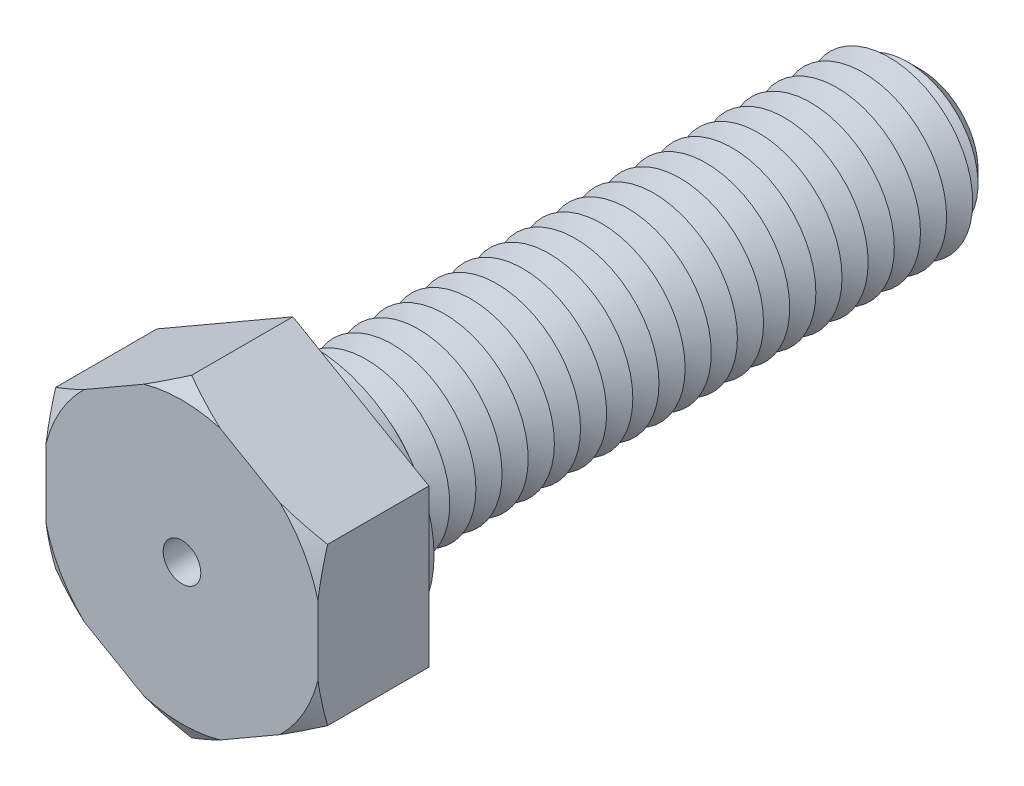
ISO-10303-21;
HEADER;
FILE_DESCRIPTION(('STEP AP214'),'2;1');
FILE_NAME('part.step','',(''),(''),'','','');
FILE_SCHEMA(('AUTOMOTIVE_DESIGN { 1 0 10303 214 1 1 1 1 }'));
ENDSEC;
DATA;
#1=APPLICATION_CONTEXT('core data for automotive mechanical design processes');
#2=APPLICATION_PROTOCOL_DEFINITION('international standard','automotive_design',2000,#1);
#3=PRODUCT_CONTEXT('',#1,'mechanical');
#4=PRODUCT('Part','Part','',(#3));
#5=PRODUCT_RELATED_PRODUCT_CATEGORY('part','',(#4));
#6=PRODUCT_DEFINITION_FORMATION('','',#4);
#7=PRODUCT_DEFINITION_CONTEXT('part definition',#1,'design');
#8=PRODUCT_DEFINITION('design','',#6,#7);
#9=PRODUCT_DEFINITION_SHAPE('','',#8);
#10=(LENGTH_UNIT() NAMED_UNIT(*) SI_UNIT(.MILLI.,.METRE.));
#11=(NAMED_UNIT(*) PLANE_ANGLE_UNIT() SI_UNIT($,.RADIAN.));
#12=(NAMED_UNIT(*) SI_UNIT($,.STERADIAN.) SOLID_ANGLE_UNIT());
#13=UNCERTAINTY_MEASURE_WITH_UNIT(LENGTH_MEASURE(1.E-05),#10,'distance_accuracy_value','');
#14=(GEOMETRIC_REPRESENTATION_CONTEXT(3) GLOBAL_UNCERTAINTY_ASSIGNED_CONTEXT((#13)) GLOBAL_UNIT_ASSIGNED_CONTEXT((#10,
#11,#12)) REPRESENTATION_CONTEXT('',''));
#15=CARTESIAN_POINT('',(0.,0.,0.));
#16=DIRECTION('',(0.,0.,1.));
#17=DIRECTION('',(1.,0.,0.));
#18=AXIS2_PLACEMENT_3D('',#15,#16,#17);
#19=CARTESIAN_POINT('',(6.5,3.75277674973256,5.3));
#20=DIRECTION('',(-0.5,-0.866025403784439,0.));
#21=DIRECTION('',(0.866025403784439,-0.5,0.));
#22=AXIS2_PLACEMENT_3D('',#19,#20,#21);
#23=PLANE('',#22);
#24=CARTESIAN_POINT('',(11.0120510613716,1.14774285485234,2.77920306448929));
#25=CARTESIAN_POINT('',(10.8078344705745,1.26564735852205,2.88939185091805));
#26=CARTESIAN_POINT('',(10.6031290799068,1.38383407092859,2.99839128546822));
#27=CARTESIAN_POINT('',(10.1925345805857,1.6208909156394,3.21345290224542));
#28=CARTESIAN_POINT('',(9.98664532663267,1.73976113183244,3.31951471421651));
#29=CARTESIAN_POINT('',(9.57286478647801,1.97865743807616,3.52844955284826));
#30=CARTESIAN_POINT('',(9.36496919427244,2.09868601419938,3.63131124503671));
#31=CARTESIAN_POINT('',(8.9476201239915,2.33964261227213,3.83272114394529));
#32=CARTESIAN_POINT('',(8.73816669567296,2.46057060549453,3.93126948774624));
#33=CARTESIAN_POINT('',(8.31210847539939,2.70655543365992,4.12554493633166));
#34=CARTESIAN_POINT('',(8.0954571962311,2.83163910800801,4.22113674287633));
#35=CARTESIAN_POINT('',(7.65996896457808,3.0830683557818,4.40550790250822));
#36=CARTESIAN_POINT('',(7.44113190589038,3.2094139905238,4.49428692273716));
#37=CARTESIAN_POINT('',(7.00122142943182,3.46339642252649,4.66334180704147));
#38=CARTESIAN_POINT('',(6.78015039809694,3.59103184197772,4.74362587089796));
#39=CARTESIAN_POINT('',(6.3354128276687,3.8478011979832,4.89383693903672));
#40=CARTESIAN_POINT('',(6.11174662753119,3.97693493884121,4.96376527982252));
#41=CARTESIAN_POINT('',(5.57683009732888,4.2857691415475,5.11501441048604));
#42=CARTESIAN_POINT('',(5.26433342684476,4.46618917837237,5.19069976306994));
#43=CARTESIAN_POINT('',(4.79238520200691,4.73866861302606,5.28165255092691));
#44=CARTESIAN_POINT('',(4.63453792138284,4.82980178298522,5.30820735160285));
#45=CARTESIAN_POINT('',(4.31797843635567,5.01256748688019,5.35312391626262));
#46=CARTESIAN_POINT('',(4.15926635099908,5.10419995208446,5.37148678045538));
#47=CARTESIAN_POINT('',(3.84309853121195,5.28673952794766,5.3993333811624));
#48=CARTESIAN_POINT('',(3.68564943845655,5.37764280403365,5.40891715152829));
#49=CARTESIAN_POINT('',(3.37053331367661,5.55957518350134,5.41928234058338));
#50=CARTESIAN_POINT('',(3.21286628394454,5.65060428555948,5.42006385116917));
#51=CARTESIAN_POINT('',(2.89768626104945,5.83257355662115,5.4127996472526));
#52=CARTESIAN_POINT('',(2.74017326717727,5.92351372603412,5.40475397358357));
#53=CARTESIAN_POINT('',(2.42563627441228,6.10511174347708,5.38007889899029));
#54=CARTESIAN_POINT('',(2.26861235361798,6.19576954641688,5.36344819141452));
#55=CARTESIAN_POINT('',(1.8976455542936,6.40994732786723,5.31443879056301));
#56=CARTESIAN_POINT('',(1.6840512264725,6.53326607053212,5.27851525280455));
#57=CARTESIAN_POINT('',(1.25890710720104,6.77872314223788,5.19313397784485));
#58=CARTESIAN_POINT('',(1.04735761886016,6.90086129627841,5.14367426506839));
#59=CARTESIAN_POINT('',(0.626329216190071,7.14394215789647,5.03308780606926));
#60=CARTESIAN_POINT('',(0.416852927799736,7.26488334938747,4.97194786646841));
#61=CARTESIAN_POINT('',(0.000251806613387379,7.50540811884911,4.83992704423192));
#62=CARTESIAN_POINT('',(-0.206873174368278,7.62499178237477,4.76904677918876));
#63=CARTESIAN_POINT('',(-0.621367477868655,7.86430018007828,4.61833709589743));
#64=CARTESIAN_POINT('',(-0.828710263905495,7.98400959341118,4.53841104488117));
#65=CARTESIAN_POINT('',(-1.2411992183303,8.22216020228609,4.3718486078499));
#66=CARTESIAN_POINT('',(-1.44634674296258,8.34060218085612,4.2852166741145));
#67=CARTESIAN_POINT('',(-1.85477207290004,8.57640665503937,4.10643213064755));
#68=CARTESIAN_POINT('',(-2.05805026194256,8.69376937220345,4.01428068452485));
#69=CARTESIAN_POINT('',(-2.46301289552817,8.92757465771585,3.82542322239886));
#70=CARTESIAN_POINT('',(-2.66469731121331,9.04401720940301,3.72871712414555));
#71=CARTESIAN_POINT('',(-3.00477721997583,9.24036243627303,3.56190249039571));
#72=CARTESIAN_POINT('',(-3.14353507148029,9.32047431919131,3.49277477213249));
#73=CARTESIAN_POINT('',(-3.42044427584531,9.48034792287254,3.35293264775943));
#74=CARTESIAN_POINT('',(-3.55859564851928,9.56010965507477,3.28221829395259));
#75=CARTESIAN_POINT('',(-3.83290330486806,9.71848125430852,3.14014092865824));
#76=CARTESIAN_POINT('',(-3.96906528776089,9.79709441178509,3.06879256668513));
#77=CARTESIAN_POINT('',(-4.24090766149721,9.9540426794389,2.92487520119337));
#78=CARTESIAN_POINT('',(-4.37658804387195,10.0323777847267,2.85230617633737));
#79=CARTESIAN_POINT('',(-4.5120510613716,10.1105873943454,2.77920306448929));
#80=B_SPLINE_CURVE_WITH_KNOTS('',3,(#24,#25,#26,#27,#28,#29,#30,#31,#32,#33,#34,#35,#36,#37,#38,
#39,#40,#41,#42,#43,#44,#45,#46,#47,#48,#49,#50,#51,#52,#53,#54,#55,#56,#57,#58,#59,#60,#61,#62,
#63,#64,#65,#66,#67,#68,#69,#70,#71,#72,#73,#74,#75,#76,#77,#78,#79),.UNSPECIFIED.,.F.,.F.,(4,2,
2,2,2,2,2,2,2,2,2,2,2,2,2,2,2,2,2,2,2,2,2,2,2,2,2,4),(0.,0.780858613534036,1.56181520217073,
2.34527979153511,3.12871946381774,3.93206444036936,4.73544864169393,5.53805016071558,
6.34054800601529,7.44542333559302,7.99784254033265,8.55018753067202,9.096157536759,
9.64212184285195,10.1880836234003,10.7341285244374,11.4813961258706,12.2287728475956,
12.9769988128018,13.7251773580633,14.4822772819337,15.2388787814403,15.9953213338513,
16.7517775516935,17.2752695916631,17.7987444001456,18.3167123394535,18.8346893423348),.UNSPECIFIED.);
#81=CARTESIAN_POINT('',(6.5,3.75277674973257,4.83811978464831));
#82=VERTEX_POINT('',#81);
#83=CARTESIAN_POINT('',(4.67682717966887,4.80538606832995,5.3));
#84=VERTEX_POINT('',#83);
#85=EDGE_CURVE('E132',#82,#84,#80,.T.);
#86=ORIENTED_EDGE('',*,*,#85,.F.);
#87=DIRECTION('',(0.,0.,-1.));
#88=VECTOR('',#87,1.);
#89=CARTESIAN_POINT('',(6.5,3.75277674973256,5.3));
#90=LINE('',#89,#88);
#91=CARTESIAN_POINT('',(6.5,3.75277674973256,0.));
#92=VERTEX_POINT('',#91);
#93=EDGE_CURVE('E144',#82,#92,#90,.T.);
#94=ORIENTED_EDGE('',*,*,#93,.T.);
#95=DIRECTION('',(-0.866025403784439,0.5,0.));
#96=VECTOR('',#95,1.);
#97=CARTESIAN_POINT('',(6.5,3.75277674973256,0.));
#98=LINE('',#97,#96);
#99=CARTESIAN_POINT('',(0.,7.50555349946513,0.));
#100=VERTEX_POINT('',#99);
#101=EDGE_CURVE('E386',#92,#100,#98,.T.);
#102=ORIENTED_EDGE('',*,*,#101,.T.);
#103=DIRECTION('',(0.,0.,-1.));
#104=VECTOR('',#103,1.);
#105=CARTESIAN_POINT('',(0.,7.50555349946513,5.3));
#106=LINE('',#105,#104);
#107=CARTESIAN_POINT('',(0.,7.50555349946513,4.83811978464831));
#108=VERTEX_POINT('',#107);
#109=EDGE_CURVE('E179',#108,#100,#106,.T.);
#110=ORIENTED_EDGE('',*,*,#109,.F.);
#111=CARTESIAN_POINT('',(1.82317282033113,6.45294418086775,5.3));
#112=VERTEX_POINT('',#111);
#113=EDGE_CURVE('E151',#112,#108,#80,.T.);
#114=ORIENTED_EDGE('',*,*,#113,.F.);
#115=DIRECTION('',(-0.866025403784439,0.5,0.));
#116=VECTOR('',#115,1.);
#117=CARTESIAN_POINT('',(6.5,3.75277674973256,5.3));
#118=LINE('',#117,#116);
#119=EDGE_CURVE('E148',#84,#112,#118,.T.);
#120=ORIENTED_EDGE('',*,*,#119,.F.);
#121=EDGE_LOOP('',(#86,#94,#102,#110,#114,#120));
#122=FACE_BOUND('',#121,.T.);
#123=ADVANCED_FACE('F39',(#122),#23,.F.);
#124=CARTESIAN_POINT('',(0.,7.50555349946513,5.3));
#125=DIRECTION('',(0.5,-0.866025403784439,0.));
#126=DIRECTION('',(0.866025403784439,0.5,0.));
#127=AXIS2_PLACEMENT_3D('',#124,#125,#126);
#128=PLANE('',#127);
#129=CARTESIAN_POINT('',(4.5120510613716,10.1105873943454,2.77920306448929));
#130=CARTESIAN_POINT('',(4.30783447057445,9.99268289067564,2.88939185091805));
#131=CARTESIAN_POINT('',(4.1031290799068,9.87449617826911,2.99839128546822));
#132=CARTESIAN_POINT('',(3.69253458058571,9.63743933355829,3.21345290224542));
#133=CARTESIAN_POINT('',(3.48664532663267,9.51856911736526,3.31951471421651));
#134=CARTESIAN_POINT('',(3.07286478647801,9.27967281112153,3.52844955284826));
#135=CARTESIAN_POINT('',(2.86496919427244,9.15964423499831,3.63131124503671));
#136=CARTESIAN_POINT('',(2.4476201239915,8.91868763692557,3.83272114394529));
#137=CARTESIAN_POINT('',(2.23816669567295,8.79775964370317,3.93126948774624));
#138=CARTESIAN_POINT('',(1.81210847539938,8.55177481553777,4.12554493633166));
#139=CARTESIAN_POINT('',(1.5954571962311,8.42669114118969,4.22113674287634));
#140=CARTESIAN_POINT('',(1.15996896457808,8.1752618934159,4.40550790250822));
#141=CARTESIAN_POINT('',(0.941131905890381,8.04891625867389,4.49428692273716));
#142=CARTESIAN_POINT('',(0.501221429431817,7.7949338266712,4.66334180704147));
#143=CARTESIAN_POINT('',(0.280150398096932,7.66729840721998,4.74362587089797));
#144=CARTESIAN_POINT('',(-0.164587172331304,7.4105290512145,4.89383693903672));
#145=CARTESIAN_POINT('',(-0.388253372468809,7.28139531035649,4.96376527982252));
#146=CARTESIAN_POINT('',(-0.923169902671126,6.9725611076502,5.11501441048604));
#147=CARTESIAN_POINT('',(-1.23566657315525,6.79214107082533,5.19069976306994));
#148=CARTESIAN_POINT('',(-1.70761479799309,6.51966163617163,5.28165255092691));
#149=CARTESIAN_POINT('',(-1.86546207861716,6.42852846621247,5.30820735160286));
#150=CARTESIAN_POINT('',(-2.18202156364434,6.24576276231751,5.35312391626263));
#151=CARTESIAN_POINT('',(-2.34073364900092,6.15413029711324,5.37148678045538));
#152=CARTESIAN_POINT('',(-2.65690146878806,5.97159072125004,5.3993333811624));
#153=CARTESIAN_POINT('',(-2.81435056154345,5.88068744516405,5.40891715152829));
#154=CARTESIAN_POINT('',(-3.12946668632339,5.69875506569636,5.41928234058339));
#155=CARTESIAN_POINT('',(-3.28713371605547,5.60772596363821,5.42006385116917));
#156=CARTESIAN_POINT('',(-3.60231373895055,5.42575669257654,5.4127996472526));
#157=CARTESIAN_POINT('',(-3.75982673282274,5.33481652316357,5.40475397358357));
#158=CARTESIAN_POINT('',(-4.07436372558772,5.15321850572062,5.38007889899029));
#159=CARTESIAN_POINT('',(-4.23138764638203,5.06256070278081,5.36344819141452));
#160=CARTESIAN_POINT('',(-4.60235444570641,4.84838292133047,5.31443879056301));
#161=CARTESIAN_POINT('',(-4.81594877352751,4.72506417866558,5.27851525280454));
#162=CARTESIAN_POINT('',(-5.24109289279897,4.47960710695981,5.19313397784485));
#163=CARTESIAN_POINT('',(-5.45264238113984,4.35746895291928,5.14367426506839));
#164=CARTESIAN_POINT('',(-5.87367078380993,4.11438809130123,5.03308780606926));
#165=CARTESIAN_POINT('',(-6.08314707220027,3.99344689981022,4.97194786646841));
#166=CARTESIAN_POINT('',(-6.49974819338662,3.75292213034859,4.83992704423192));
#167=CARTESIAN_POINT('',(-6.70687317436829,3.63333846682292,4.76904677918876));
#168=CARTESIAN_POINT('',(-7.12136747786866,3.39403006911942,4.61833709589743));
#169=CARTESIAN_POINT('',(-7.3287102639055,3.27432065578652,4.53841104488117));
#170=CARTESIAN_POINT('',(-7.74119921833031,3.03617004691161,4.3718486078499));
#171=CARTESIAN_POINT('',(-7.94634674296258,2.91772806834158,4.2852166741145));
#172=CARTESIAN_POINT('',(-8.35477207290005,2.68192359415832,4.10643213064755));
#173=CARTESIAN_POINT('',(-8.55805026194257,2.56456087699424,4.01428068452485));
#174=CARTESIAN_POINT('',(-8.96301289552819,2.33075559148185,3.82542322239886));
#175=CARTESIAN_POINT('',(-9.16469731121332,2.21431303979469,3.72871712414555));
#176=CARTESIAN_POINT('',(-9.50477721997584,2.01796781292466,3.5619024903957));
#177=CARTESIAN_POINT('',(-9.6435350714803,1.93785593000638,3.49277477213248));
#178=CARTESIAN_POINT('',(-9.92044427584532,1.77798232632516,3.35293264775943));
#179=CARTESIAN_POINT('',(-10.0585956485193,1.69822059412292,3.28221829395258));
#180=CARTESIAN_POINT('',(-10.3329033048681,1.53984899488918,3.14014092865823));
#181=CARTESIAN_POINT('',(-10.4690652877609,1.46123583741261,3.06879256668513));
#182=CARTESIAN_POINT('',(-10.7409076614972,1.3042875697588,2.92487520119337));
#183=CARTESIAN_POINT('',(-10.876588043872,1.225952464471,2.85230617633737));
#184=CARTESIAN_POINT('',(-11.0120510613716,1.14774285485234,2.77920306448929));
#185=B_SPLINE_CURVE_WITH_KNOTS('',3,(#129,#130,#131,#132,#133,#134,#135,#136,#137,#138,#139,
#140,#141,#142,#143,#144,#145,#146,#147,#148,#149,#150,#151,#152,#153,#154,#155,#156,#157,#158,
#159,#160,#161,#162,#163,#164,#165,#166,#167,#168,#169,#170,#171,#172,#173,#174,#175,#176,#177,
#178,#179,#180,#181,#182,#183,#184),.UNSPECIFIED.,.F.,.F.,(4,2,2,2,2,2,2,2,2,2,2,2,2,2,2,2,2,2,
2,2,2,2,2,2,2,2,2,4),(0.,0.780858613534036,1.56181520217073,2.34527979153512,3.12871946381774,
3.93206444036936,4.73544864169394,5.53805016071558,6.34054800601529,7.44542333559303,
7.99784254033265,8.55018753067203,9.096157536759,9.64212184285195,10.1880836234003,
10.7341285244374,11.4813961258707,12.2287728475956,12.9769988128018,13.7251773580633,
14.4822772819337,15.2388787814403,15.9953213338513,16.7517775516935,17.2752695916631,
17.7987444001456,18.3167123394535,18.8346893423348),.UNSPECIFIED.);
#186=CARTESIAN_POINT('',(-1.82317282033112,6.45294418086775,5.3));
#187=VERTEX_POINT('',#186);
#188=EDGE_CURVE('E440',#108,#187,#185,.T.);
#189=ORIENTED_EDGE('',*,*,#188,.F.);
#190=ORIENTED_EDGE('',*,*,#109,.T.);
#191=DIRECTION('',(-0.866025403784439,-0.5,0.));
#192=VECTOR('',#191,1.);
#193=CARTESIAN_POINT('',(0.,7.50555349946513,0.));
#194=LINE('',#193,#192);
#195=CARTESIAN_POINT('',(-6.5,3.75277674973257,0.));
#196=VERTEX_POINT('',#195);
#197=EDGE_CURVE('E405',#100,#196,#194,.T.);
#198=ORIENTED_EDGE('',*,*,#197,.T.);
#199=DIRECTION('',(0.,0.,-1.));
#200=VECTOR('',#199,1.);
#201=CARTESIAN_POINT('',(-6.5,3.75277674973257,5.3));
#202=LINE('',#201,#200);
#203=CARTESIAN_POINT('',(-6.5,3.75277674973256,4.83811978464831));
#204=VERTEX_POINT('',#203);
#205=EDGE_CURVE('E176',#204,#196,#202,.T.);
#206=ORIENTED_EDGE('',*,*,#205,.F.);
#207=CARTESIAN_POINT('',(-4.67682717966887,4.80538606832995,5.3));
#208=VERTEX_POINT('',#207);
#209=EDGE_CURVE('E431',#208,#204,#185,.T.);
#210=ORIENTED_EDGE('',*,*,#209,.F.);
#211=DIRECTION('',(-0.866025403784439,-0.5,0.));
#212=VECTOR('',#211,1.);
#213=CARTESIAN_POINT('',(0.,7.50555349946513,5.3));
#214=LINE('',#213,#212);
#215=EDGE_CURVE('E389',#187,#208,#214,.T.);
#216=ORIENTED_EDGE('',*,*,#215,.F.);
#217=EDGE_LOOP('',(#189,#190,#198,#206,#210,#216));
#218=FACE_BOUND('',#217,.T.);
#219=ADVANCED_FACE('F487',(#218),#128,.F.);
#220=CARTESIAN_POINT('',(-6.5,3.75277674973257,5.3));
#221=DIRECTION('',(1.,0.,0.));
#222=DIRECTION('',(0.,0.,-1.));
#223=AXIS2_PLACEMENT_3D('',#220,#221,#222);
#224=PLANE('',#223);
#225=CARTESIAN_POINT('',(-6.5,8.26482781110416,3.10083044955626));
#226=CARTESIAN_POINT('',(-6.5,8.03000458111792,3.20736842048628));
#227=CARTESIAN_POINT('',(-6.5,7.79453887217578,3.31251727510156));
#228=CARTESIAN_POINT('',(-6.5,7.32204728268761,3.51936269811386));
#229=CARTESIAN_POINT('',(-6.5,7.08502112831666,3.62105864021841));
#230=CARTESIAN_POINT('',(-6.5,6.6082238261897,3.82070151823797));
#231=CARTESIAN_POINT('',(-6.5,6.36844534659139,3.91863101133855));
#232=CARTESIAN_POINT('',(-6.5,5.88686103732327,4.10935828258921));
#233=CARTESIAN_POINT('',(-6.5,5.64505530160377,4.20215629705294));
#234=CARTESIAN_POINT('',(-6.5,5.16020806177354,4.38107583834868));
#235=CARTESIAN_POINT('',(-6.5,4.91717698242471,4.46722547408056));
#236=CARTESIAN_POINT('',(-6.5,4.42851680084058,4.63190822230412));
#237=CARTESIAN_POINT('',(-6.5,4.18288757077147,4.71044095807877));
#238=CARTESIAN_POINT('',(-6.5,3.68915983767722,4.85808723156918));
#239=CARTESIAN_POINT('',(-6.5,3.44106517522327,4.9272135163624));
#240=CARTESIAN_POINT('',(-6.5,2.94198131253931,5.05420795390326));
#241=CARTESIAN_POINT('',(-6.5,2.69099223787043,5.1120765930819));
#242=CARTESIAN_POINT('',(-6.5,2.25769005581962,5.19995201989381));
#243=CARTESIAN_POINT('',(-6.5,2.07603591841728,5.23320954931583));
#244=CARTESIAN_POINT('',(-6.5,1.71151122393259,5.29207741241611));
#245=CARTESIAN_POINT('',(-6.5,1.52864087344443,5.31768901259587));
#246=CARTESIAN_POINT('',(-6.5,1.16195360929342,5.36059506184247));
#247=CARTESIAN_POINT('',(-6.5,0.978136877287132,5.37789105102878));
#248=CARTESIAN_POINT('',(-6.5,0.609880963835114,5.40367049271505));
#249=CARTESIAN_POINT('',(-6.5,0.425441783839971,5.41215396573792));
#250=CARTESIAN_POINT('',(-6.5,0.0564612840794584,5.42004368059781));
#251=CARTESIAN_POINT('',(-6.5,-0.128079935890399,5.41945454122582));
#252=CARTESIAN_POINT('',(-6.5,-0.49690745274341,5.40922941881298));
#253=CARTESIAN_POINT('',(-6.5,-0.681193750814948,5.39959347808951));
#254=CARTESIAN_POINT('',(-6.5,-1.04910266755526,5.37156866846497));
#255=CARTESIAN_POINT('',(-6.5,-1.23272526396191,5.35317950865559));
#256=CARTESIAN_POINT('',(-6.5,-1.5989735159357,5.30817918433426));
#257=CARTESIAN_POINT('',(-6.5,-1.78159898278,5.28156651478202));
#258=CARTESIAN_POINT('',(-6.5,-2.5090476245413,5.16009602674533));
#259=CARTESIAN_POINT('',(-6.5,-3.04897729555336,5.0350728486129));
#260=CARTESIAN_POINT('',(-6.5,-3.8489021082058,4.8122065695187));
#261=CARTESIAN_POINT('',(-6.5,-4.11422810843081,4.73189887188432));
#262=CARTESIAN_POINT('',(-6.5,-4.64182213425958,4.5617271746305));
#263=CARTESIAN_POINT('',(-6.5,-4.90409037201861,4.47186384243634));
#264=CARTESIAN_POINT('',(-6.5,-5.42881258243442,4.28339622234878));
#265=CARTESIAN_POINT('',(-6.5,-5.69123450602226,4.18470387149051));
#266=CARTESIAN_POINT('',(-6.5,-6.21363007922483,3.98100889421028));
#267=CARTESIAN_POINT('',(-6.5,-6.4736035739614,3.87600587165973));
#268=CARTESIAN_POINT('',(-6.5,-6.98982707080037,3.66159357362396));
#269=CARTESIAN_POINT('',(-6.5,-7.24609016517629,3.55221565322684));
#270=CARTESIAN_POINT('',(-6.5,-7.75676014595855,3.32937132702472));
#271=CARTESIAN_POINT('',(-6.5,-8.0111674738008,3.21590593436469));
#272=CARTESIAN_POINT('',(-6.5,-8.26482781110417,3.10083044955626));
#273=B_SPLINE_CURVE_WITH_KNOTS('',3,(#225,#226,#227,#228,#229,#230,#231,#232,#233,#234,#235,
#236,#237,#238,#239,#240,#241,#242,#243,#244,#245,#246,#247,#248,#249,#250,#251,#252,#253,#254,
#255,#256,#257,#258,#259,#260,#261,#262,#263,#264,#265,#266,#267,#268,#269,#270,#271,#272),
.UNSPECIFIED.,.F.,.F.,(4,2,2,2,2,2,2,2,2,2,2,2,2,2,2,2,2,2,2,2,2,2,2,4),(0.,0.773595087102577,
1.54732974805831,2.3242977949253,3.10123003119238,3.87467353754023,4.64815527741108,
5.42057817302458,6.19296768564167,6.74684672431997,7.30063396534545,7.85431860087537,
8.40800194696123,8.96140342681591,9.51480231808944,10.0682196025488,10.621738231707,
12.2804682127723,13.1120468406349,13.9435674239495,14.7845791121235,15.625643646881,
16.4614935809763,17.2971377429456),.UNSPECIFIED.);
#274=CARTESIAN_POINT('',(-6.5,1.64755811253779,5.3));
#275=VERTEX_POINT('',#274);
#276=EDGE_CURVE('E430',#204,#275,#273,.T.);
#277=ORIENTED_EDGE('',*,*,#276,.F.);
#278=ORIENTED_EDGE('',*,*,#205,.T.);
#279=DIRECTION('',(0.,-1.,0.));
#280=VECTOR('',#279,1.);
#281=CARTESIAN_POINT('',(-6.5,3.75277674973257,0.));
#282=LINE('',#281,#280);
#283=CARTESIAN_POINT('',(-6.5,-3.75277674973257,0.));
#284=VERTEX_POINT('',#283);
#285=EDGE_CURVE('E409',#196,#284,#282,.T.);
#286=ORIENTED_EDGE('',*,*,#285,.T.);
#287=DIRECTION('',(0.,0.,-1.));
#288=VECTOR('',#287,1.);
#289=CARTESIAN_POINT('',(-6.5,-3.75277674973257,5.3));
#290=LINE('',#289,#288);
#291=CARTESIAN_POINT('',(-6.49999999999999,-3.75277674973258,4.83811978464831));
#292=VERTEX_POINT('',#291);
#293=EDGE_CURVE('E173',#292,#284,#290,.T.);
#294=ORIENTED_EDGE('',*,*,#293,.F.);
#295=CARTESIAN_POINT('',(-6.5,-1.64755811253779,5.3));
#296=VERTEX_POINT('',#295);
#297=EDGE_CURVE('E432',#296,#292,#273,.T.);
#298=ORIENTED_EDGE('',*,*,#297,.F.);
#299=DIRECTION('',(0.,-1.,0.));
#300=VECTOR('',#299,1.);
#301=CARTESIAN_POINT('',(-6.5,3.75277674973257,5.3));
#302=LINE('',#301,#300);
#303=EDGE_CURVE('E393',#275,#296,#302,.T.);
#304=ORIENTED_EDGE('',*,*,#303,.F.);
#305=EDGE_LOOP('',(#277,#278,#286,#294,#298,#304));
#306=FACE_BOUND('',#305,.T.);
#307=ADVANCED_FACE('F490',(#306),#224,.F.);
#308=CARTESIAN_POINT('',(-6.5,-3.75277674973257,5.3));
#309=DIRECTION('',(0.5,0.866025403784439,0.));
#310=DIRECTION('',(-0.866025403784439,0.5,0.));
#311=AXIS2_PLACEMENT_3D('',#308,#309,#310);
#312=PLANE('',#311);
#313=CARTESIAN_POINT('',(-11.0120510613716,-1.14774285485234,2.77920306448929));
#314=CARTESIAN_POINT('',(-10.8078344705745,-1.26564735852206,2.88939185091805));
#315=CARTESIAN_POINT('',(-10.6031290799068,-1.3838340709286,2.99839128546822));
#316=CARTESIAN_POINT('',(-10.1925345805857,-1.62089091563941,3.21345290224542));
#317=CARTESIAN_POINT('',(-9.98664532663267,-1.73976113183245,3.31951471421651));
#318=CARTESIAN_POINT('',(-9.572864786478,-1.97865743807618,3.52844955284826));
#319=CARTESIAN_POINT('',(-9.36496919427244,-2.09868601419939,3.63131124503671));
#320=CARTESIAN_POINT('',(-8.94762012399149,-2.33964261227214,3.83272114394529));
#321=CARTESIAN_POINT('',(-8.73816669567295,-2.46057060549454,3.93126948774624));
#322=CARTESIAN_POINT('',(-8.31210847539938,-2.70655543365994,4.12554493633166));
#323=CARTESIAN_POINT('',(-8.0954571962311,-2.83163910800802,4.22113674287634));
#324=CARTESIAN_POINT('',(-7.65996896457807,-3.08306835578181,4.40550790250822));
#325=CARTESIAN_POINT('',(-7.44113190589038,-3.20941399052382,4.49428692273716));
#326=CARTESIAN_POINT('',(-7.00122142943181,-3.46339642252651,4.66334180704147));
#327=CARTESIAN_POINT('',(-6.78015039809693,-3.59103184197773,4.74362587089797));
#328=CARTESIAN_POINT('',(-6.33541282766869,-3.84780119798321,4.89383693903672));
#329=CARTESIAN_POINT('',(-6.11174662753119,-3.97693493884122,4.96376527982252));
#330=CARTESIAN_POINT('',(-5.57683009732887,-4.28576914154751,5.11501441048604));
#331=CARTESIAN_POINT('',(-5.26433342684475,-4.46618917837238,5.19069976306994));
#332=CARTESIAN_POINT('',(-4.7923852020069,-4.73866861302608,5.28165255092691));
#333=CARTESIAN_POINT('',(-4.63453792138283,-4.82980178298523,5.30820735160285));
#334=CARTESIAN_POINT('',(-4.31797843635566,-5.0125674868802,5.35312391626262));
#335=CARTESIAN_POINT('',(-4.15926635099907,-5.10419995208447,5.37148678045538));
#336=CARTESIAN_POINT('',(-3.84309853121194,-5.28673952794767,5.39933338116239));
#337=CARTESIAN_POINT('',(-3.68564943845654,-5.37764280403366,5.40891715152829));
#338=CARTESIAN_POINT('',(-3.3705333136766,-5.55957518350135,5.41928234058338));
#339=CARTESIAN_POINT('',(-3.21286628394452,-5.6506042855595,5.42006385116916));
#340=CARTESIAN_POINT('',(-2.89768626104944,-5.83257355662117,5.41279964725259));
#341=CARTESIAN_POINT('',(-2.74017326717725,-5.92351372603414,5.40475397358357));
#342=CARTESIAN_POINT('',(-2.42563627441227,-6.1051117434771,5.38007889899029));
#343=CARTESIAN_POINT('',(-2.26861235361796,-6.1957695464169,5.36344819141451));
#344=CARTESIAN_POINT('',(-1.89764555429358,-6.40994732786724,5.314438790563));
#345=CARTESIAN_POINT('',(-1.68405122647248,-6.53326607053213,5.27851525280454));
#346=CARTESIAN_POINT('',(-1.25890710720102,-6.7787231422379,5.19313397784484));
#347=CARTESIAN_POINT('',(-1.04735761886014,-6.90086129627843,5.14367426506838));
#348=CARTESIAN_POINT('',(-0.626329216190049,-7.14394215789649,5.03308780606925));
#349=CARTESIAN_POINT('',(-0.416852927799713,-7.26488334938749,4.9719478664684));
#350=CARTESIAN_POINT('',(-0.000251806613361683,-7.50540811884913,4.83992704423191));
#351=CARTESIAN_POINT('',(0.206873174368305,-7.62499178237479,4.76904677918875));
#352=CARTESIAN_POINT('',(0.621367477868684,-7.8643001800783,4.61833709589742));
#353=CARTESIAN_POINT('',(0.828710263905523,-7.9840095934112,4.53841104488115));
#354=CARTESIAN_POINT('',(1.24119921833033,-8.22216020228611,4.37184860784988));
#355=CARTESIAN_POINT('',(1.44634674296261,-8.34060218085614,4.28521667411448));
#356=CARTESIAN_POINT('',(1.85477207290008,-8.5764066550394,4.10643213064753));
#357=CARTESIAN_POINT('',(2.0580502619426,-8.69376937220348,4.01428068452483));
#358=CARTESIAN_POINT('',(2.46301289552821,-8.92757465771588,3.82542322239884));
#359=CARTESIAN_POINT('',(2.66469731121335,-9.04401720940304,3.72871712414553));
#360=CARTESIAN_POINT('',(3.00477721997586,-9.24036243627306,3.56190249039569));
#361=CARTESIAN_POINT('',(3.14353507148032,-9.32047431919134,3.49277477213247));
#362=CARTESIAN_POINT('',(3.42044427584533,-9.48034792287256,3.35293264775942));
#363=CARTESIAN_POINT('',(3.55859564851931,-9.56010965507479,3.28221829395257));
#364=CARTESIAN_POINT('',(3.83290330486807,-9.71848125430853,3.14014092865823));
#365=CARTESIAN_POINT('',(3.9690652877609,-9.7970944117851,3.06879256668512));
#366=CARTESIAN_POINT('',(4.24090766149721,-9.9540426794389,2.92487520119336));
#367=CARTESIAN_POINT('',(4.37658804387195,-10.0323777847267,2.85230617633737));
#368=CARTESIAN_POINT('',(4.51205106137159,-10.1105873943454,2.77920306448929));
#369=B_SPLINE_CURVE_WITH_KNOTS('',3,(#313,#314,#315,#316,#317,#318,#319,#320,#321,#322,#323,
#324,#325,#326,#327,#328,#329,#330,#331,#332,#333,#334,#335,#336,#337,#338,#339,#340,#341,#342,
#343,#344,#345,#346,#347,#348,#349,#350,#351,#352,#353,#354,#355,#356,#357,#358,#359,#360,#361,
#362,#363,#364,#365,#366,#367,#368),.UNSPECIFIED.,.F.,.F.,(4,2,2,2,2,2,2,2,2,2,2,2,2,2,2,2,2,2,
2,2,2,2,2,2,2,2,2,4),(0.,0.780858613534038,1.56181520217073,2.34527979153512,3.12871946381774,
3.93206444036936,4.73544864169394,5.53805016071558,6.3405480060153,7.44542333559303,
7.99784254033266,8.55018753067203,9.09615753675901,9.64212184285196,10.1880836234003,
10.7341285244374,11.4813961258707,12.2287728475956,12.9769988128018,13.7251773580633,
14.4822772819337,15.2388787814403,15.9953213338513,16.7517775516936,17.2752695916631,
17.7987444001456,18.3167123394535,18.8346893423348),.UNSPECIFIED.);
#370=CARTESIAN_POINT('',(-4.67682717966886,-4.80538606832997,5.3));
#371=VERTEX_POINT('',#370);
#372=EDGE_CURVE('E427',#292,#371,#369,.T.);
#373=ORIENTED_EDGE('',*,*,#372,.F.);
#374=ORIENTED_EDGE('',*,*,#293,.T.);
#375=DIRECTION('',(0.866025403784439,-0.5,0.));
#376=VECTOR('',#375,1.);
#377=CARTESIAN_POINT('',(-6.5,-3.75277674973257,0.));
#378=LINE('',#377,#376);
#379=CARTESIAN_POINT('',(0.,-7.50555349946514,0.));
#380=VERTEX_POINT('',#379);
#381=EDGE_CURVE('E413',#284,#380,#378,.T.);
#382=ORIENTED_EDGE('',*,*,#381,.T.);
#383=DIRECTION('',(0.,0.,-1.));
#384=VECTOR('',#383,1.);
#385=CARTESIAN_POINT('',(0.,-7.50555349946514,5.3));
#386=LINE('',#385,#384);
#387=CARTESIAN_POINT('',(0.,-7.50555349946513,4.83811978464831));
#388=VERTEX_POINT('',#387);
#389=EDGE_CURVE('E163',#388,#380,#386,.T.);
#390=ORIENTED_EDGE('',*,*,#389,.F.);
#391=CARTESIAN_POINT('',(-1.82317282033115,-6.45294418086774,5.3));
#392=VERTEX_POINT('',#391);
#393=EDGE_CURVE('E426',#392,#388,#369,.T.);
#394=ORIENTED_EDGE('',*,*,#393,.F.);
#395=DIRECTION('',(0.866025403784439,-0.5,0.));
#396=VECTOR('',#395,1.);
#397=CARTESIAN_POINT('',(-6.5,-3.75277674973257,5.3));
#398=LINE('',#397,#396);
#399=EDGE_CURVE('E397',#371,#392,#398,.T.);
#400=ORIENTED_EDGE('',*,*,#399,.F.);
#401=EDGE_LOOP('',(#373,#374,#382,#390,#394,#400));
#402=FACE_BOUND('',#401,.T.);
#403=ADVANCED_FACE('F459',(#402),#312,.F.);
#404=CARTESIAN_POINT('',(0.,-7.50555349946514,5.3));
#405=DIRECTION('',(-0.5,0.866025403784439,0.));
#406=DIRECTION('',(-0.866025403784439,-0.5,0.));
#407=AXIS2_PLACEMENT_3D('',#404,#405,#406);
#408=PLANE('',#407);
#409=CARTESIAN_POINT('',(-4.5120510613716,-10.1105873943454,2.77920306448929));
#410=CARTESIAN_POINT('',(-4.30783447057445,-9.99268289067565,2.88939185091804));
#411=CARTESIAN_POINT('',(-4.1031290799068,-9.87449617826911,2.99839128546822));
#412=CARTESIAN_POINT('',(-3.69253458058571,-9.6374393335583,3.21345290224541));
#413=CARTESIAN_POINT('',(-3.48664532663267,-9.51856911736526,3.3195147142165));
#414=CARTESIAN_POINT('',(-3.072864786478,-9.27967281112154,3.52844955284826));
#415=CARTESIAN_POINT('',(-2.86496919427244,-9.15964423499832,3.6313112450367));
#416=CARTESIAN_POINT('',(-2.4476201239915,-8.91868763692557,3.83272114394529));
#417=CARTESIAN_POINT('',(-2.23816669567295,-8.79775964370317,3.93126948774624));
#418=CARTESIAN_POINT('',(-1.81210847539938,-8.55177481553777,4.12554493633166));
#419=CARTESIAN_POINT('',(-1.5954571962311,-8.42669114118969,4.22113674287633));
#420=CARTESIAN_POINT('',(-1.15996896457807,-8.1752618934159,4.40550790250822));
#421=CARTESIAN_POINT('',(-0.941131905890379,-8.04891625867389,4.49428692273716));
#422=CARTESIAN_POINT('',(-0.501221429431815,-7.79493382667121,4.66334180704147));
#423=CARTESIAN_POINT('',(-0.28015039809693,-7.66729840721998,4.74362587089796));
#424=CARTESIAN_POINT('',(0.164587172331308,-7.4105290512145,4.89383693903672));
#425=CARTESIAN_POINT('',(0.388253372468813,-7.28139531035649,4.96376527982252));
#426=CARTESIAN_POINT('',(0.92316990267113,-6.9725611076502,5.11501441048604));
#427=CARTESIAN_POINT('',(1.23566657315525,-6.79214107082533,5.19069976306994));
#428=CARTESIAN_POINT('',(1.7076147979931,-6.51966163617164,5.28165255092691));
#429=CARTESIAN_POINT('',(1.86546207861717,-6.42852846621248,5.30820735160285));
#430=CARTESIAN_POINT('',(2.18202156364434,-6.24576276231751,5.35312391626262));
#431=CARTESIAN_POINT('',(2.34073364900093,-6.15413029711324,5.37148678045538));
#432=CARTESIAN_POINT('',(2.65690146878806,-5.97159072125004,5.3993333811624));
#433=CARTESIAN_POINT('',(2.81435056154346,-5.88068744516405,5.40891715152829));
#434=CARTESIAN_POINT('',(3.1294666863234,-5.69875506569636,5.41928234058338));
#435=CARTESIAN_POINT('',(3.28713371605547,-5.60772596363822,5.42006385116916));
#436=CARTESIAN_POINT('',(3.60231373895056,-5.42575669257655,5.41279964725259));
#437=CARTESIAN_POINT('',(3.75982673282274,-5.33481652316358,5.40475397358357));
#438=CARTESIAN_POINT('',(4.07436372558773,-5.15321850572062,5.38007889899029));
#439=CARTESIAN_POINT('',(4.23138764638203,-5.06256070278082,5.36344819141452));
#440=CARTESIAN_POINT('',(4.60235444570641,-4.84838292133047,5.31443879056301));
#441=CARTESIAN_POINT('',(4.81594877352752,-4.72506417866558,5.27851525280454));
#442=CARTESIAN_POINT('',(5.24109289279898,-4.47960710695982,5.19313397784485));
#443=CARTESIAN_POINT('',(5.45264238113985,-4.35746895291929,5.14367426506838));
#444=CARTESIAN_POINT('',(5.87367078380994,-4.11438809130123,5.03308780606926));
#445=CARTESIAN_POINT('',(6.08314707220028,-3.99344689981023,4.9719478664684));
#446=CARTESIAN_POINT('',(6.49974819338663,-3.75292213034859,4.83992704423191));
#447=CARTESIAN_POINT('',(6.7068731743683,-3.63333846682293,4.76904677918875));
#448=CARTESIAN_POINT('',(7.12136747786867,-3.39403006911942,4.61833709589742));
#449=CARTESIAN_POINT('',(7.32871026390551,-3.27432065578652,4.53841104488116));
#450=CARTESIAN_POINT('',(7.74119921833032,-3.03617004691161,4.37184860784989));
#451=CARTESIAN_POINT('',(7.9463467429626,-2.91772806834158,4.28521667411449));
#452=CARTESIAN_POINT('',(8.35477207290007,-2.68192359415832,4.10643213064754));
#453=CARTESIAN_POINT('',(8.55805026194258,-2.56456087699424,4.01428068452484));
#454=CARTESIAN_POINT('',(8.9630128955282,-2.33075559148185,3.82542322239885));
#455=CARTESIAN_POINT('',(9.16469731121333,-2.21431303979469,3.72871712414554));
#456=CARTESIAN_POINT('',(9.50477721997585,-2.01796781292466,3.56190249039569));
#457=CARTESIAN_POINT('',(9.64353507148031,-1.93785593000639,3.49277477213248));
#458=CARTESIAN_POINT('',(9.92044427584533,-1.77798232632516,3.35293264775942));
#459=CARTESIAN_POINT('',(10.0585956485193,-1.69822059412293,3.28221829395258));
#460=CARTESIAN_POINT('',(10.3329033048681,-1.53984899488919,3.14014092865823));
#461=CARTESIAN_POINT('',(10.4690652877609,-1.46123583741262,3.06879256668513));
#462=CARTESIAN_POINT('',(10.7409076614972,-1.30428756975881,2.92487520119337));
#463=CARTESIAN_POINT('',(10.876588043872,-1.22595246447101,2.85230617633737));
#464=CARTESIAN_POINT('',(11.0120510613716,-1.14774285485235,2.77920306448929));
#465=B_SPLINE_CURVE_WITH_KNOTS('',3,(#409,#410,#411,#412,#413,#414,#415,#416,#417,#418,#419,
#420,#421,#422,#423,#424,#425,#426,#427,#428,#429,#430,#431,#432,#433,#434,#435,#436,#437,#438,
#439,#440,#441,#442,#443,#444,#445,#446,#447,#448,#449,#450,#451,#452,#453,#454,#455,#456,#457,
#458,#459,#460,#461,#462,#463,#464),.UNSPECIFIED.,.F.,.F.,(4,2,2,2,2,2,2,2,2,2,2,2,2,2,2,2,2,2,
2,2,2,2,2,2,2,2,2,4),(0.,0.780858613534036,1.56181520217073,2.34527979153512,3.12871946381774,
3.93206444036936,4.73544864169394,5.53805016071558,6.3405480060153,7.44542333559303,
7.99784254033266,8.55018753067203,9.09615753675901,9.64212184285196,10.1880836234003,
10.7341285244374,11.4813961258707,12.2287728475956,12.9769988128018,13.7251773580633,
14.4822772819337,15.2388787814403,15.9953213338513,16.7517775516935,17.2752695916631,
17.7987444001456,18.3167123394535,18.8346893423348),.UNSPECIFIED.);
#466=CARTESIAN_POINT('',(1.82317282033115,-6.45294418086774,5.3));
#467=VERTEX_POINT('',#466);
#468=EDGE_CURVE('E64',#388,#467,#465,.T.);
#469=ORIENTED_EDGE('',*,*,#468,.F.);
#470=ORIENTED_EDGE('',*,*,#389,.T.);
#471=DIRECTION('',(0.866025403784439,0.5,0.));
#472=VECTOR('',#471,1.);
#473=CARTESIAN_POINT('',(0.,-7.50555349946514,0.));
#474=LINE('',#473,#472);
#475=CARTESIAN_POINT('',(6.5,-3.75277674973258,0.));
#476=VERTEX_POINT('',#475);
#477=EDGE_CURVE('E416',#380,#476,#474,.T.);
#478=ORIENTED_EDGE('',*,*,#477,.T.);
#479=DIRECTION('',(0.,0.,-1.));
#480=VECTOR('',#479,1.);
#481=CARTESIAN_POINT('',(6.5,-3.75277674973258,5.3));
#482=LINE('',#481,#480);
#483=CARTESIAN_POINT('',(6.5,-3.75277674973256,4.83811978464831));
#484=VERTEX_POINT('',#483);
#485=EDGE_CURVE('E157',#484,#476,#482,.T.);
#486=ORIENTED_EDGE('',*,*,#485,.F.);
#487=CARTESIAN_POINT('',(4.67682717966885,-4.80538606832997,5.3));
#488=VERTEX_POINT('',#487);
#489=EDGE_CURVE('E436',#488,#484,#465,.T.);
#490=ORIENTED_EDGE('',*,*,#489,.F.);
#491=DIRECTION('',(0.866025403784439,0.5,0.));
#492=VECTOR('',#491,1.);
#493=CARTESIAN_POINT('',(0.,-7.50555349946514,5.3));
#494=LINE('',#493,#492);
#495=EDGE_CURVE('E166',#467,#488,#494,.T.);
#496=ORIENTED_EDGE('',*,*,#495,.F.);
#497=EDGE_LOOP('',(#469,#470,#478,#486,#490,#496));
#498=FACE_BOUND('',#497,.T.);
#499=ADVANCED_FACE('F528',(#498),#408,.F.);
#500=CARTESIAN_POINT('',(6.5,-3.75277674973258,5.3));
#501=DIRECTION('',(-1.,0.,0.));
#502=DIRECTION('',(0.,-1.,0.));
#503=AXIS2_PLACEMENT_3D('',#500,#501,#502);
#504=PLANE('',#503);
#505=CARTESIAN_POINT('',(6.5,-8.26482781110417,3.10083044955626));
#506=CARTESIAN_POINT('',(6.5,-8.03000458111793,3.20736842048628));
#507=CARTESIAN_POINT('',(6.5,-7.79453887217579,3.31251727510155));
#508=CARTESIAN_POINT('',(6.5,-7.32204728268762,3.51936269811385));
#509=CARTESIAN_POINT('',(6.5,-7.08502112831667,3.62105864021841));
#510=CARTESIAN_POINT('',(6.5,-6.60822382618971,3.82070151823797));
#511=CARTESIAN_POINT('',(6.5,-6.3684453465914,3.91863101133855));
#512=CARTESIAN_POINT('',(6.5,-5.88686103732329,4.10935828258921));
#513=CARTESIAN_POINT('',(6.5,-5.64505530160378,4.20215629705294));
#514=CARTESIAN_POINT('',(6.5,-5.16020806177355,4.38107583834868));
#515=CARTESIAN_POINT('',(6.5,-4.91717698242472,4.46722547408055));
#516=CARTESIAN_POINT('',(6.5,-4.42851680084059,4.63190822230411));
#517=CARTESIAN_POINT('',(6.5,-4.18288757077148,4.71044095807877));
#518=CARTESIAN_POINT('',(6.5,-3.68915983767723,4.85808723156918));
#519=CARTESIAN_POINT('',(6.5,-3.44106517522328,4.9272135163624));
#520=CARTESIAN_POINT('',(6.5,-2.94198131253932,5.05420795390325));
#521=CARTESIAN_POINT('',(6.5,-2.69099223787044,5.1120765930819));
#522=CARTESIAN_POINT('',(6.5,-2.25769005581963,5.19995201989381));
#523=CARTESIAN_POINT('',(6.5,-2.07603591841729,5.23320954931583));
#524=CARTESIAN_POINT('',(6.5,-1.7115112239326,5.29207741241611));
#525=CARTESIAN_POINT('',(6.5,-1.52864087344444,5.31768901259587));
#526=CARTESIAN_POINT('',(6.5,-1.16195360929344,5.36059506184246));
#527=CARTESIAN_POINT('',(6.5,-0.978136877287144,5.37789105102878));
#528=CARTESIAN_POINT('',(6.5,-0.609880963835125,5.40367049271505));
#529=CARTESIAN_POINT('',(6.5,-0.425441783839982,5.41215396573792));
#530=CARTESIAN_POINT('',(6.5,-0.056461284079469,5.42004368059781));
#531=CARTESIAN_POINT('',(6.5,0.128079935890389,5.41945454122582));
#532=CARTESIAN_POINT('',(6.5,0.496907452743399,5.40922941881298));
#533=CARTESIAN_POINT('',(6.5,0.681193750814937,5.39959347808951));
#534=CARTESIAN_POINT('',(6.5,1.04910266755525,5.37156866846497));
#535=CARTESIAN_POINT('',(6.5,1.2327252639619,5.35317950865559));
#536=CARTESIAN_POINT('',(6.5,1.59897351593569,5.30817918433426));
#537=CARTESIAN_POINT('',(6.5,1.78159898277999,5.28156651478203));
#538=CARTESIAN_POINT('',(6.5,2.50904762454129,5.16009602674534));
#539=CARTESIAN_POINT('',(6.5,3.04897729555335,5.0350728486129));
#540=CARTESIAN_POINT('',(6.5,3.84890210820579,4.8122065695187));
#541=CARTESIAN_POINT('',(6.5,4.1142281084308,4.73189887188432));
#542=CARTESIAN_POINT('',(6.5,4.64182213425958,4.5617271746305));
#543=CARTESIAN_POINT('',(6.5,4.9040903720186,4.47186384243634));
#544=CARTESIAN_POINT('',(6.5,5.42881258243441,4.28339622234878));
#545=CARTESIAN_POINT('',(6.5,5.69123450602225,4.18470387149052));
#546=CARTESIAN_POINT('',(6.5,6.21363007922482,3.98100889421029));
#547=CARTESIAN_POINT('',(6.5,6.47360357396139,3.87600587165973));
#548=CARTESIAN_POINT('',(6.5,6.98982707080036,3.66159357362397));
#549=CARTESIAN_POINT('',(6.5,7.24609016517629,3.55221565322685));
#550=CARTESIAN_POINT('',(6.5,7.75676014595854,3.32937132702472));
#551=CARTESIAN_POINT('',(6.5,8.01116747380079,3.21590593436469));
#552=CARTESIAN_POINT('',(6.5,8.26482781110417,3.10083044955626));
#553=B_SPLINE_CURVE_WITH_KNOTS('',3,(#505,#506,#507,#508,#509,#510,#511,#512,#513,#514,#515,
#516,#517,#518,#519,#520,#521,#522,#523,#524,#525,#526,#527,#528,#529,#530,#531,#532,#533,#534,
#535,#536,#537,#538,#539,#540,#541,#542,#543,#544,#545,#546,#547,#548,#549,#550,#551,#552),
.UNSPECIFIED.,.F.,.F.,(4,2,2,2,2,2,2,2,2,2,2,2,2,2,2,2,2,2,2,2,2,2,2,4),(0.,0.773595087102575,
1.54732974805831,2.3242977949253,3.10123003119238,3.87467353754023,4.64815527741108,
5.42057817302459,6.19296768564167,6.74684672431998,7.30063396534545,7.85431860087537,
8.40800194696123,8.96140342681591,9.51480231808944,10.0682196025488,10.621738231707,
12.2804682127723,13.1120468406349,13.9435674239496,14.7845791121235,15.625643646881,
16.4614935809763,17.2971377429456),.UNSPECIFIED.);
#554=CARTESIAN_POINT('',(6.5,-1.64755811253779,5.3));
#555=VERTEX_POINT('',#554);
#556=EDGE_CURVE('E56',#484,#555,#553,.T.);
#557=ORIENTED_EDGE('',*,*,#556,.F.);
#558=ORIENTED_EDGE('',*,*,#485,.T.);
#559=DIRECTION('',(0.,1.,0.));
#560=VECTOR('',#559,1.);
#561=CARTESIAN_POINT('',(6.5,-3.75277674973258,0.));
#562=LINE('',#561,#560);
#563=EDGE_CURVE('E154',#476,#92,#562,.T.);
#564=ORIENTED_EDGE('',*,*,#563,.T.);
#565=ORIENTED_EDGE('',*,*,#93,.F.);
#566=CARTESIAN_POINT('',(6.5,1.64755811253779,5.3));
#567=VERTEX_POINT('',#566);
#568=EDGE_CURVE('E129',#567,#82,#553,.T.);
#569=ORIENTED_EDGE('',*,*,#568,.F.);
#570=DIRECTION('',(0.,1.,0.));
#571=VECTOR('',#570,1.);
#572=CARTESIAN_POINT('',(6.5,-3.75277674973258,5.3));
#573=LINE('',#572,#571);
#574=EDGE_CURVE('E158',#555,#567,#573,.T.);
#575=ORIENTED_EDGE('',*,*,#574,.F.);
#576=EDGE_LOOP('',(#557,#558,#564,#565,#569,#575));
#577=FACE_BOUND('',#576,.T.);
#578=ADVANCED_FACE('F152',(#577),#504,.F.);
#579=CARTESIAN_POINT('',(0.,0.,5.3));
#580=DIRECTION('',(0.,0.,1.));
#581=DIRECTION('',(1.,0.,0.));
#582=AXIS2_PLACEMENT_3D('',#579,#580,#581);
#583=PLANE('',#582);
#584=CARTESIAN_POINT('',(0.,0.,5.3));
#585=DIRECTION('',(0.,0.,1.));
#586=DIRECTION('',(1.,0.,0.));
#587=AXIS2_PLACEMENT_3D('',#584,#585,#586);
#588=CIRCLE('',#587,0.9);
#589=CARTESIAN_POINT('',(0.9,0.,5.3));
#590=VERTEX_POINT('',#589);
#591=EDGE_CURVE('E424',#590,#590,#588,.T.);
#592=ORIENTED_EDGE('',*,*,#591,.F.);
#593=EDGE_LOOP('',(#592));
#594=FACE_BOUND('',#593,.T.);
#595=ORIENTED_EDGE('',*,*,#574,.T.);
#596=CARTESIAN_POINT('',(0.,0.,5.3));
#597=DIRECTION('',(0.,0.,1.));
#598=DIRECTION('',(1.,0.,0.));
#599=AXIS2_PLACEMENT_3D('',#596,#597,#598);
#600=CIRCLE('',#599,6.70555349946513);
#601=EDGE_CURVE('E134',#567,#84,#600,.T.);
#602=ORIENTED_EDGE('',*,*,#601,.T.);
#603=ORIENTED_EDGE('',*,*,#119,.T.);
#604=CARTESIAN_POINT('',(0.,0.,5.3));
#605=DIRECTION('',(0.,0.,1.));
#606=DIRECTION('',(1.,0.,0.));
#607=AXIS2_PLACEMENT_3D('',#604,#605,#606);
#608=CIRCLE('',#607,6.70555349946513);
#609=EDGE_CURVE('E11',#112,#187,#608,.T.);
#610=ORIENTED_EDGE('',*,*,#609,.T.);
#611=ORIENTED_EDGE('',*,*,#215,.T.);
#612=EDGE_CURVE('E49',#208,#275,#608,.T.);
#613=ORIENTED_EDGE('',*,*,#612,.T.);
#614=ORIENTED_EDGE('',*,*,#303,.T.);
#615=EDGE_CURVE('E523',#296,#371,#608,.T.);
#616=ORIENTED_EDGE('',*,*,#615,.T.);
#617=ORIENTED_EDGE('',*,*,#399,.T.);
#618=EDGE_CURVE('E521',#392,#467,#608,.T.);
#619=ORIENTED_EDGE('',*,*,#618,.T.);
#620=ORIENTED_EDGE('',*,*,#495,.T.);
#621=EDGE_CURVE('E43',#488,#555,#608,.T.);
#622=ORIENTED_EDGE('',*,*,#621,.T.);
#623=EDGE_LOOP('',(#595,#602,#603,#610,#611,#613,#614,#616,#617,#619,#620,#622));
#624=FACE_BOUND('',#623,.T.);
#625=ADVANCED_FACE('F520',(#594,#624),#583,.T.);
#626=CARTESIAN_POINT('',(0.,0.,0.));
#627=DIRECTION('',(0.,0.,1.));
#628=DIRECTION('',(1.,0.,0.));
#629=AXIS2_PLACEMENT_3D('',#626,#627,#628);
#630=PLANE('',#629);
#631=CARTESIAN_POINT('',(0.,0.,0.));
#632=DIRECTION('',(0.,0.,1.));
#633=DIRECTION('',(1.,0.,0.));
#634=AXIS2_PLACEMENT_3D('',#631,#632,#633);
#635=CIRCLE('',#634,5.75);
#636=CARTESIAN_POINT('',(5.75,0.,0.));
#637=VERTEX_POINT('',#636);
#638=EDGE_CURVE('E182',#637,#637,#635,.F.);
#639=ORIENTED_EDGE('',*,*,#638,.F.);
#640=EDGE_LOOP('',(#639));
#641=FACE_BOUND('',#640,.T.);
#642=ORIENTED_EDGE('',*,*,#101,.F.);
#643=ORIENTED_EDGE('',*,*,#563,.F.);
#644=ORIENTED_EDGE('',*,*,#477,.F.);
#645=ORIENTED_EDGE('',*,*,#381,.F.);
#646=ORIENTED_EDGE('',*,*,#285,.F.);
#647=ORIENTED_EDGE('',*,*,#197,.F.);
#648=EDGE_LOOP('',(#642,#643,#644,#645,#646,#647));
#649=FACE_BOUND('',#648,.T.);
#650=ADVANCED_FACE('F513',(#641,#649),#630,.F.);
#651=CARTESIAN_POINT('',(0.,0.,-1.));
#652=DIRECTION('',(0.,0.,1.));
#653=DIRECTION('',(1.,0.,0.));
#654=AXIS2_PLACEMENT_3D('',#651,#652,#653);
#655=CYLINDRICAL_SURFACE('',#654,5.75);
#656=CARTESIAN_POINT('',(0.,0.,-1.));
#657=DIRECTION('',(0.,0.,-1.));
#658=DIRECTION('',(-1.,0.,0.));
#659=AXIS2_PLACEMENT_3D('',#656,#657,#658);
#660=CIRCLE('',#659,5.75);
#661=CARTESIAN_POINT('',(-5.75,0.,-1.));
#662=VERTEX_POINT('',#661);
#663=EDGE_CURVE('E382',#662,#662,#660,.T.);
#664=ORIENTED_EDGE('',*,*,#663,.F.);
#665=EDGE_LOOP('',(#664));
#666=FACE_BOUND('',#665,.T.);
#667=ORIENTED_EDGE('',*,*,#638,.T.);
#668=EDGE_LOOP('',(#667));
#669=FACE_BOUND('',#668,.T.);
#670=ADVANCED_FACE('F568',(#666,#669),#655,.T.);
#671=CARTESIAN_POINT('',(0.,0.,-1.));
#672=DIRECTION('',(0.,0.,-1.));
#673=DIRECTION('',(-1.,0.,0.));
#674=AXIS2_PLACEMENT_3D('',#671,#672,#673);
#675=PLANE('',#674);
#676=CARTESIAN_POINT('',(0.,0.,-1.));
#677=DIRECTION('',(0.,0.,1.));
#678=DIRECTION('',(1.,0.,0.));
#679=AXIS2_PLACEMENT_3D('',#676,#677,#678);
#680=CIRCLE('',#679,4.);
#681=CARTESIAN_POINT('',(4.,0.,-1.));
#682=VERTEX_POINT('',#681);
#683=EDGE_CURVE('E378',#682,#682,#680,.T.);
#684=ORIENTED_EDGE('',*,*,#683,.T.);
#685=EDGE_LOOP('',(#684));
#686=FACE_BOUND('',#685,.T.);
#687=ORIENTED_EDGE('',*,*,#663,.T.);
#688=EDGE_LOOP('',(#687));
#689=FACE_BOUND('',#688,.T.);
#690=ADVANCED_FACE('F1085',(#686,#689),#675,.T.);
#691=CARTESIAN_POINT('',(0.,0.,-1.));
#692=DIRECTION('',(0.,0.,1.));
#693=DIRECTION('',(1.,0.,0.));
#694=AXIS2_PLACEMENT_3D('',#691,#692,#693);
#695=CONICAL_SURFACE('',#694,4.,1.0471975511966);
#696=CARTESIAN_POINT('',(0.,0.,-1.625));
#697=DIRECTION('',(0.,0.,1.));
#698=DIRECTION('',(1.,0.,0.));
#699=AXIS2_PLACEMENT_3D('',#696,#697,#698);
#700=CIRCLE('',#699,2.91746824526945);
#701=CARTESIAN_POINT('',(2.91746824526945,0.,-1.625));
#702=VERTEX_POINT('',#701);
#703=EDGE_CURVE('E374',#702,#702,#700,.T.);
#704=ORIENTED_EDGE('',*,*,#703,.T.);
#705=EDGE_LOOP('',(#704));
#706=FACE_BOUND('',#705,.T.);
#707=ORIENTED_EDGE('',*,*,#683,.F.);
#708=EDGE_LOOP('',(#707));
#709=FACE_BOUND('',#708,.T.);
#710=ADVANCED_FACE('F1076',(#706,#709),#695,.T.);
#711=CARTESIAN_POINT('',(0.,0.,-1.625));
#712=DIRECTION('',(0.,0.,-1.));
#713=DIRECTION('',(-1.,0.,0.));
#714=AXIS2_PLACEMENT_3D('',#711,#712,#713);
#715=CONICAL_SURFACE('',#714,2.91746824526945,1.0471975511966);
#716=CARTESIAN_POINT('',(0.,0.,-2.25));
#717=DIRECTION('',(0.,0.,1.));
#718=DIRECTION('',(1.,0.,0.));
#719=AXIS2_PLACEMENT_3D('',#716,#717,#718);
#720=CIRCLE('',#719,4.);
#721=CARTESIAN_POINT('',(4.,0.,-2.25));
#722=VERTEX_POINT('',#721);
#723=EDGE_CURVE('E370',#722,#722,#720,.T.);
#724=ORIENTED_EDGE('',*,*,#723,.T.);
#725=EDGE_LOOP('',(#724));
#726=FACE_BOUND('',#725,.T.);
#727=ORIENTED_EDGE('',*,*,#703,.F.);
#728=EDGE_LOOP('',(#727));
#729=FACE_BOUND('',#728,.T.);
#730=ADVANCED_FACE('F1067',(#726,#729),#715,.T.);
#731=CARTESIAN_POINT('',(0.,0.,-2.25));
#732=DIRECTION('',(0.,0.,1.));
#733=DIRECTION('',(1.,0.,0.));
#734=AXIS2_PLACEMENT_3D('',#731,#732,#733);
#735=CONICAL_SURFACE('',#734,4.,1.0471975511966);
#736=CARTESIAN_POINT('',(0.,0.,-2.875));
#737=DIRECTION('',(0.,0.,1.));
#738=DIRECTION('',(1.,0.,0.));
#739=AXIS2_PLACEMENT_3D('',#736,#737,#738);
#740=CIRCLE('',#739,2.91746824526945);
#741=CARTESIAN_POINT('',(2.91746824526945,0.,-2.875));
#742=VERTEX_POINT('',#741);
#743=EDGE_CURVE('E366',#742,#742,#740,.T.);
#744=ORIENTED_EDGE('',*,*,#743,.T.);
#745=EDGE_LOOP('',(#744));
#746=FACE_BOUND('',#745,.T.);
#747=ORIENTED_EDGE('',*,*,#723,.F.);
#748=EDGE_LOOP('',(#747));
#749=FACE_BOUND('',#748,.T.);
#750=ADVANCED_FACE('F1058',(#746,#749),#735,.T.);
#751=CARTESIAN_POINT('',(0.,0.,-2.875));
#752=DIRECTION('',(0.,0.,-1.));
#753=DIRECTION('',(-1.,0.,0.));
#754=AXIS2_PLACEMENT_3D('',#751,#752,#753);
#755=CONICAL_SURFACE('',#754,2.91746824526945,1.0471975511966);
#756=CARTESIAN_POINT('',(0.,0.,-3.5));
#757=DIRECTION('',(0.,0.,1.));
#758=DIRECTION('',(1.,0.,0.));
#759=AXIS2_PLACEMENT_3D('',#756,#757,#758);
#760=CIRCLE('',#759,4.);
#761=CARTESIAN_POINT('',(4.,0.,-3.5));
#762=VERTEX_POINT('',#761);
#763=EDGE_CURVE('E362',#762,#762,#760,.T.);
#764=ORIENTED_EDGE('',*,*,#763,.T.);
#765=EDGE_LOOP('',(#764));
#766=FACE_BOUND('',#765,.T.);
#767=ORIENTED_EDGE('',*,*,#743,.F.);
#768=EDGE_LOOP('',(#767));
#769=FACE_BOUND('',#768,.T.);
#770=ADVANCED_FACE('F1049',(#766,#769),#755,.T.);
#771=CARTESIAN_POINT('',(0.,0.,-3.5));
#772=DIRECTION('',(0.,0.,1.));
#773=DIRECTION('',(1.,0.,0.));
#774=AXIS2_PLACEMENT_3D('',#771,#772,#773);
#775=CONICAL_SURFACE('',#774,4.,1.0471975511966);
#776=CARTESIAN_POINT('',(0.,0.,-4.125));
#777=DIRECTION('',(0.,0.,1.));
#778=DIRECTION('',(1.,0.,0.));
#779=AXIS2_PLACEMENT_3D('',#776,#777,#778);
#780=CIRCLE('',#779,2.91746824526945);
#781=CARTESIAN_POINT('',(2.91746824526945,0.,-4.125));
#782=VERTEX_POINT('',#781);
#783=EDGE_CURVE('E358',#782,#782,#780,.T.);
#784=ORIENTED_EDGE('',*,*,#783,.T.);
#785=EDGE_LOOP('',(#784));
#786=FACE_BOUND('',#785,.T.);
#787=ORIENTED_EDGE('',*,*,#763,.F.);
#788=EDGE_LOOP('',(#787));
#789=FACE_BOUND('',#788,.T.);
#790=ADVANCED_FACE('F1040',(#786,#789),#775,.T.);
#791=CARTESIAN_POINT('',(0.,0.,-4.125));
#792=DIRECTION('',(0.,0.,-1.));
#793=DIRECTION('',(-1.,0.,0.));
#794=AXIS2_PLACEMENT_3D('',#791,#792,#793);
#795=CONICAL_SURFACE('',#794,2.91746824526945,1.0471975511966);
#796=CARTESIAN_POINT('',(0.,0.,-4.75));
#797=DIRECTION('',(0.,0.,1.));
#798=DIRECTION('',(1.,0.,0.));
#799=AXIS2_PLACEMENT_3D('',#796,#797,#798);
#800=CIRCLE('',#799,4.);
#801=CARTESIAN_POINT('',(4.,0.,-4.75));
#802=VERTEX_POINT('',#801);
#803=EDGE_CURVE('E354',#802,#802,#800,.T.);
#804=ORIENTED_EDGE('',*,*,#803,.T.);
#805=EDGE_LOOP('',(#804));
#806=FACE_BOUND('',#805,.T.);
#807=ORIENTED_EDGE('',*,*,#783,.F.);
#808=EDGE_LOOP('',(#807));
#809=FACE_BOUND('',#808,.T.);
#810=ADVANCED_FACE('F1031',(#806,#809),#795,.T.);
#811=CARTESIAN_POINT('',(0.,0.,-4.75));
#812=DIRECTION('',(0.,0.,1.));
#813=DIRECTION('',(1.,0.,0.));
#814=AXIS2_PLACEMENT_3D('',#811,#812,#813);
#815=CONICAL_SURFACE('',#814,4.,1.0471975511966);
#816=CARTESIAN_POINT('',(0.,0.,-5.375));
#817=DIRECTION('',(0.,0.,1.));
#818=DIRECTION('',(1.,0.,0.));
#819=AXIS2_PLACEMENT_3D('',#816,#817,#818);
#820=CIRCLE('',#819,2.91746824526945);
#821=CARTESIAN_POINT('',(2.91746824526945,0.,-5.375));
#822=VERTEX_POINT('',#821);
#823=EDGE_CURVE('E350',#822,#822,#820,.T.);
#824=ORIENTED_EDGE('',*,*,#823,.T.);
#825=EDGE_LOOP('',(#824));
#826=FACE_BOUND('',#825,.T.);
#827=ORIENTED_EDGE('',*,*,#803,.F.);
#828=EDGE_LOOP('',(#827));
#829=FACE_BOUND('',#828,.T.);
#830=ADVANCED_FACE('F1022',(#826,#829),#815,.T.);
#831=CARTESIAN_POINT('',(0.,0.,-5.375));
#832=DIRECTION('',(0.,0.,-1.));
#833=DIRECTION('',(-1.,0.,0.));
#834=AXIS2_PLACEMENT_3D('',#831,#832,#833);
#835=CONICAL_SURFACE('',#834,2.91746824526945,1.0471975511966);
#836=CARTESIAN_POINT('',(0.,0.,-6.));
#837=DIRECTION('',(0.,0.,1.));
#838=DIRECTION('',(1.,0.,0.));
#839=AXIS2_PLACEMENT_3D('',#836,#837,#838);
#840=CIRCLE('',#839,4.);
#841=CARTESIAN_POINT('',(4.,0.,-6.));
#842=VERTEX_POINT('',#841);
#843=EDGE_CURVE('E346',#842,#842,#840,.T.);
#844=ORIENTED_EDGE('',*,*,#843,.T.);
#845=EDGE_LOOP('',(#844));
#846=FACE_BOUND('',#845,.T.);
#847=ORIENTED_EDGE('',*,*,#823,.F.);
#848=EDGE_LOOP('',(#847));
#849=FACE_BOUND('',#848,.T.);
#850=ADVANCED_FACE('F1013',(#846,#849),#835,.T.);
#851=CARTESIAN_POINT('',(0.,0.,-6.));
#852=DIRECTION('',(0.,0.,1.));
#853=DIRECTION('',(1.,0.,0.));
#854=AXIS2_PLACEMENT_3D('',#851,#852,#853);
#855=CONICAL_SURFACE('',#854,4.,1.0471975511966);
#856=CARTESIAN_POINT('',(0.,0.,-6.625));
#857=DIRECTION('',(0.,0.,1.));
#858=DIRECTION('',(1.,0.,0.));
#859=AXIS2_PLACEMENT_3D('',#856,#857,#858);
#860=CIRCLE('',#859,2.91746824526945);
#861=CARTESIAN_POINT('',(2.91746824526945,0.,-6.625));
#862=VERTEX_POINT('',#861);
#863=EDGE_CURVE('E342',#862,#862,#860,.T.);
#864=ORIENTED_EDGE('',*,*,#863,.T.);
#865=EDGE_LOOP('',(#864));
#866=FACE_BOUND('',#865,.T.);
#867=ORIENTED_EDGE('',*,*,#843,.F.);
#868=EDGE_LOOP('',(#867));
#869=FACE_BOUND('',#868,.T.);
#870=ADVANCED_FACE('F1004',(#866,#869),#855,.T.);
#871=CARTESIAN_POINT('',(0.,0.,-6.625));
#872=DIRECTION('',(0.,0.,-1.));
#873=DIRECTION('',(-1.,0.,0.));
#874=AXIS2_PLACEMENT_3D('',#871,#872,#873);
#875=CONICAL_SURFACE('',#874,2.91746824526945,1.0471975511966);
#876=CARTESIAN_POINT('',(0.,0.,-7.25));
#877=DIRECTION('',(0.,0.,1.));
#878=DIRECTION('',(1.,0.,0.));
#879=AXIS2_PLACEMENT_3D('',#876,#877,#878);
#880=CIRCLE('',#879,4.);
#881=CARTESIAN_POINT('',(4.,0.,-7.25));
#882=VERTEX_POINT('',#881);
#883=EDGE_CURVE('E338',#882,#882,#880,.T.);
#884=ORIENTED_EDGE('',*,*,#883,.T.);
#885=EDGE_LOOP('',(#884));
#886=FACE_BOUND('',#885,.T.);
#887=ORIENTED_EDGE('',*,*,#863,.F.);
#888=EDGE_LOOP('',(#887));
#889=FACE_BOUND('',#888,.T.);
#890=ADVANCED_FACE('F995',(#886,#889),#875,.T.);
#891=CARTESIAN_POINT('',(0.,0.,-7.25));
#892=DIRECTION('',(0.,0.,1.));
#893=DIRECTION('',(1.,0.,0.));
#894=AXIS2_PLACEMENT_3D('',#891,#892,#893);
#895=CONICAL_SURFACE('',#894,4.,1.0471975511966);
#896=CARTESIAN_POINT('',(0.,0.,-7.875));
#897=DIRECTION('',(0.,0.,1.));
#898=DIRECTION('',(1.,0.,0.));
#899=AXIS2_PLACEMENT_3D('',#896,#897,#898);
#900=CIRCLE('',#899,2.91746824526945);
#901=CARTESIAN_POINT('',(2.91746824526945,0.,-7.875));
#902=VERTEX_POINT('',#901);
#903=EDGE_CURVE('E334',#902,#902,#900,.T.);
#904=ORIENTED_EDGE('',*,*,#903,.T.);
#905=EDGE_LOOP('',(#904));
#906=FACE_BOUND('',#905,.T.);
#907=ORIENTED_EDGE('',*,*,#883,.F.);
#908=EDGE_LOOP('',(#907));
#909=FACE_BOUND('',#908,.T.);
#910=ADVANCED_FACE('F986',(#906,#909),#895,.T.);
#911=CARTESIAN_POINT('',(0.,0.,-7.875));
#912=DIRECTION('',(0.,0.,-1.));
#913=DIRECTION('',(-1.,0.,0.));
#914=AXIS2_PLACEMENT_3D('',#911,#912,#913);
#915=CONICAL_SURFACE('',#914,2.91746824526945,1.0471975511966);
#916=CARTESIAN_POINT('',(0.,0.,-8.5));
#917=DIRECTION('',(0.,0.,1.));
#918=DIRECTION('',(1.,0.,0.));
#919=AXIS2_PLACEMENT_3D('',#916,#917,#918);
#920=CIRCLE('',#919,4.);
#921=CARTESIAN_POINT('',(4.,0.,-8.5));
#922=VERTEX_POINT('',#921);
#923=EDGE_CURVE('E330',#922,#922,#920,.T.);
#924=ORIENTED_EDGE('',*,*,#923,.T.);
#925=EDGE_LOOP('',(#924));
#926=FACE_BOUND('',#925,.T.);
#927=ORIENTED_EDGE('',*,*,#903,.F.);
#928=EDGE_LOOP('',(#927));
#929=FACE_BOUND('',#928,.T.);
#930=ADVANCED_FACE('F977',(#926,#929),#915,.T.);
#931=CARTESIAN_POINT('',(0.,0.,-8.5));
#932=DIRECTION('',(0.,0.,1.));
#933=DIRECTION('',(1.,0.,0.));
#934=AXIS2_PLACEMENT_3D('',#931,#932,#933);
#935=CONICAL_SURFACE('',#934,4.,1.0471975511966);
#936=CARTESIAN_POINT('',(0.,0.,-9.125));
#937=DIRECTION('',(0.,0.,1.));
#938=DIRECTION('',(1.,0.,0.));
#939=AXIS2_PLACEMENT_3D('',#936,#937,#938);
#940=CIRCLE('',#939,2.91746824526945);
#941=CARTESIAN_POINT('',(2.91746824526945,0.,-9.125));
#942=VERTEX_POINT('',#941);
#943=EDGE_CURVE('E326',#942,#942,#940,.T.);
#944=ORIENTED_EDGE('',*,*,#943,.T.);
#945=EDGE_LOOP('',(#944));
#946=FACE_BOUND('',#945,.T.);
#947=ORIENTED_EDGE('',*,*,#923,.F.);
#948=EDGE_LOOP('',(#947));
#949=FACE_BOUND('',#948,.T.);
#950=ADVANCED_FACE('F968',(#946,#949),#935,.T.);
#951=CARTESIAN_POINT('',(0.,0.,-9.125));
#952=DIRECTION('',(0.,0.,-1.));
#953=DIRECTION('',(-1.,0.,0.));
#954=AXIS2_PLACEMENT_3D('',#951,#952,#953);
#955=CONICAL_SURFACE('',#954,2.91746824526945,1.0471975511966);
#956=CARTESIAN_POINT('',(0.,0.,-9.75));
#957=DIRECTION('',(0.,0.,1.));
#958=DIRECTION('',(1.,0.,0.));
#959=AXIS2_PLACEMENT_3D('',#956,#957,#958);
#960=CIRCLE('',#959,4.);
#961=CARTESIAN_POINT('',(4.,0.,-9.75));
#962=VERTEX_POINT('',#961);
#963=EDGE_CURVE('E323',#962,#962,#960,.T.);
#964=ORIENTED_EDGE('',*,*,#963,.T.);
#965=EDGE_LOOP('',(#964));
#966=FACE_BOUND('',#965,.T.);
#967=ORIENTED_EDGE('',*,*,#943,.F.);
#968=EDGE_LOOP('',(#967));
#969=FACE_BOUND('',#968,.T.);
#970=ADVANCED_FACE('F959',(#966,#969),#955,.T.);
#971=CARTESIAN_POINT('',(0.,0.,-9.75));
#972=DIRECTION('',(0.,0.,1.));
#973=DIRECTION('',(1.,0.,0.));
#974=AXIS2_PLACEMENT_3D('',#971,#972,#973);
#975=CONICAL_SURFACE('',#974,4.,1.0471975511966);
#976=CARTESIAN_POINT('',(0.,0.,-10.375));
#977=DIRECTION('',(0.,0.,1.));
#978=DIRECTION('',(1.,0.,0.));
#979=AXIS2_PLACEMENT_3D('',#976,#977,#978);
#980=CIRCLE('',#979,2.91746824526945);
#981=CARTESIAN_POINT('',(2.91746824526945,0.,-10.375));
#982=VERTEX_POINT('',#981);
#983=EDGE_CURVE('E319',#982,#982,#980,.T.);
#984=ORIENTED_EDGE('',*,*,#983,.T.);
#985=EDGE_LOOP('',(#984));
#986=FACE_BOUND('',#985,.T.);
#987=ORIENTED_EDGE('',*,*,#963,.F.);
#988=EDGE_LOOP('',(#987));
#989=FACE_BOUND('',#988,.T.);
#990=ADVANCED_FACE('F950',(#986,#989),#975,.T.);
#991=CARTESIAN_POINT('',(0.,0.,-10.375));
#992=DIRECTION('',(0.,0.,-1.));
#993=DIRECTION('',(-1.,0.,0.));
#994=AXIS2_PLACEMENT_3D('',#991,#992,#993);
#995=CONICAL_SURFACE('',#994,2.91746824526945,1.0471975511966);
#996=CARTESIAN_POINT('',(0.,0.,-11.));
#997=DIRECTION('',(0.,0.,1.));
#998=DIRECTION('',(1.,0.,0.));
#999=AXIS2_PLACEMENT_3D('',#996,#997,#998);
#1000=CIRCLE('',#999,4.);
#1001=CARTESIAN_POINT('',(4.,0.,-11.));
#1002=VERTEX_POINT('',#1001);
#1003=EDGE_CURVE('E315',#1002,#1002,#1000,.T.);
#1004=ORIENTED_EDGE('',*,*,#1003,.T.);
#1005=EDGE_LOOP('',(#1004));
#1006=FACE_BOUND('',#1005,.T.);
#1007=ORIENTED_EDGE('',*,*,#983,.F.);
#1008=EDGE_LOOP('',(#1007));
#1009=FACE_BOUND('',#1008,.T.);
#1010=ADVANCED_FACE('F941',(#1006,#1009),#995,.T.);
#1011=CARTESIAN_POINT('',(0.,0.,-11.));
#1012=DIRECTION('',(0.,0.,1.));
#1013=DIRECTION('',(1.,0.,0.));
#1014=AXIS2_PLACEMENT_3D('',#1011,#1012,#1013);
#1015=CONICAL_SURFACE('',#1014,4.,1.0471975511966);
#1016=CARTESIAN_POINT('',(0.,0.,-11.625));
#1017=DIRECTION('',(0.,0.,1.));
#1018=DIRECTION('',(1.,0.,0.));
#1019=AXIS2_PLACEMENT_3D('',#1016,#1017,#1018);
#1020=CIRCLE('',#1019,2.91746824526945);
#1021=CARTESIAN_POINT('',(2.91746824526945,0.,-11.625));
#1022=VERTEX_POINT('',#1021);
#1023=EDGE_CURVE('E311',#1022,#1022,#1020,.T.);
#1024=ORIENTED_EDGE('',*,*,#1023,.T.);
#1025=EDGE_LOOP('',(#1024));
#1026=FACE_BOUND('',#1025,.T.);
#1027=ORIENTED_EDGE('',*,*,#1003,.F.);
#1028=EDGE_LOOP('',(#1027));
#1029=FACE_BOUND('',#1028,.T.);
#1030=ADVANCED_FACE('F932',(#1026,#1029),#1015,.T.);
#1031=CARTESIAN_POINT('',(0.,0.,-11.625));
#1032=DIRECTION('',(0.,0.,-1.));
#1033=DIRECTION('',(-1.,0.,0.));
#1034=AXIS2_PLACEMENT_3D('',#1031,#1032,#1033);
#1035=CONICAL_SURFACE('',#1034,2.91746824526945,1.0471975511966);
#1036=CARTESIAN_POINT('',(0.,0.,-12.25));
#1037=DIRECTION('',(0.,0.,1.));
#1038=DIRECTION('',(1.,0.,0.));
#1039=AXIS2_PLACEMENT_3D('',#1036,#1037,#1038);
#1040=CIRCLE('',#1039,4.);
#1041=CARTESIAN_POINT('',(4.,0.,-12.25));
#1042=VERTEX_POINT('',#1041);
#1043=EDGE_CURVE('E307',#1042,#1042,#1040,.T.);
#1044=ORIENTED_EDGE('',*,*,#1043,.T.);
#1045=EDGE_LOOP('',(#1044));
#1046=FACE_BOUND('',#1045,.T.);
#1047=ORIENTED_EDGE('',*,*,#1023,.F.);
#1048=EDGE_LOOP('',(#1047));
#1049=FACE_BOUND('',#1048,.T.);
#1050=ADVANCED_FACE('F923',(#1046,#1049),#1035,.T.);
#1051=CARTESIAN_POINT('',(0.,0.,-12.25));
#1052=DIRECTION('',(0.,0.,1.));
#1053=DIRECTION('',(1.,0.,0.));
#1054=AXIS2_PLACEMENT_3D('',#1051,#1052,#1053);
#1055=CONICAL_SURFACE('',#1054,4.,1.0471975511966);
#1056=CARTESIAN_POINT('',(0.,0.,-12.875));
#1057=DIRECTION('',(0.,0.,1.));
#1058=DIRECTION('',(1.,0.,0.));
#1059=AXIS2_PLACEMENT_3D('',#1056,#1057,#1058);
#1060=CIRCLE('',#1059,2.91746824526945);
#1061=CARTESIAN_POINT('',(2.91746824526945,0.,-12.875));
#1062=VERTEX_POINT('',#1061);
#1063=EDGE_CURVE('E303',#1062,#1062,#1060,.T.);
#1064=ORIENTED_EDGE('',*,*,#1063,.T.);
#1065=EDGE_LOOP('',(#1064));
#1066=FACE_BOUND('',#1065,.T.);
#1067=ORIENTED_EDGE('',*,*,#1043,.F.);
#1068=EDGE_LOOP('',(#1067));
#1069=FACE_BOUND('',#1068,.T.);
#1070=ADVANCED_FACE('F914',(#1066,#1069),#1055,.T.);
#1071=CARTESIAN_POINT('',(0.,0.,-12.875));
#1072=DIRECTION('',(0.,0.,-1.));
#1073=DIRECTION('',(-1.,0.,0.));
#1074=AXIS2_PLACEMENT_3D('',#1071,#1072,#1073);
#1075=CONICAL_SURFACE('',#1074,2.91746824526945,1.0471975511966);
#1076=CARTESIAN_POINT('',(0.,0.,-13.5));
#1077=DIRECTION('',(0.,0.,1.));
#1078=DIRECTION('',(1.,0.,0.));
#1079=AXIS2_PLACEMENT_3D('',#1076,#1077,#1078);
#1080=CIRCLE('',#1079,4.);
#1081=CARTESIAN_POINT('',(4.,0.,-13.5));
#1082=VERTEX_POINT('',#1081);
#1083=EDGE_CURVE('E299',#1082,#1082,#1080,.T.);
#1084=ORIENTED_EDGE('',*,*,#1083,.T.);
#1085=EDGE_LOOP('',(#1084));
#1086=FACE_BOUND('',#1085,.T.);
#1087=ORIENTED_EDGE('',*,*,#1063,.F.);
#1088=EDGE_LOOP('',(#1087));
#1089=FACE_BOUND('',#1088,.T.);
#1090=ADVANCED_FACE('F905',(#1086,#1089),#1075,.T.);
#1091=CARTESIAN_POINT('',(0.,0.,-13.5));
#1092=DIRECTION('',(0.,0.,1.));
#1093=DIRECTION('',(1.,0.,0.));
#1094=AXIS2_PLACEMENT_3D('',#1091,#1092,#1093);
#1095=CONICAL_SURFACE('',#1094,4.,1.0471975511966);
#1096=CARTESIAN_POINT('',(0.,0.,-14.125));
#1097=DIRECTION('',(0.,0.,1.));
#1098=DIRECTION('',(1.,0.,0.));
#1099=AXIS2_PLACEMENT_3D('',#1096,#1097,#1098);
#1100=CIRCLE('',#1099,2.91746824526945);
#1101=CARTESIAN_POINT('',(2.91746824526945,0.,-14.125));
#1102=VERTEX_POINT('',#1101);
#1103=EDGE_CURVE('E295',#1102,#1102,#1100,.T.);
#1104=ORIENTED_EDGE('',*,*,#1103,.T.);
#1105=EDGE_LOOP('',(#1104));
#1106=FACE_BOUND('',#1105,.T.);
#1107=ORIENTED_EDGE('',*,*,#1083,.F.);
#1108=EDGE_LOOP('',(#1107));
#1109=FACE_BOUND('',#1108,.T.);
#1110=ADVANCED_FACE('F896',(#1106,#1109),#1095,.T.);
#1111=CARTESIAN_POINT('',(0.,0.,-14.125));
#1112=DIRECTION('',(0.,0.,-1.));
#1113=DIRECTION('',(-1.,0.,0.));
#1114=AXIS2_PLACEMENT_3D('',#1111,#1112,#1113);
#1115=CONICAL_SURFACE('',#1114,2.91746824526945,1.0471975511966);
#1116=CARTESIAN_POINT('',(0.,0.,-14.75));
#1117=DIRECTION('',(0.,0.,1.));
#1118=DIRECTION('',(1.,0.,0.));
#1119=AXIS2_PLACEMENT_3D('',#1116,#1117,#1118);
#1120=CIRCLE('',#1119,4.);
#1121=CARTESIAN_POINT('',(4.,0.,-14.75));
#1122=VERTEX_POINT('',#1121);
#1123=EDGE_CURVE('E291',#1122,#1122,#1120,.T.);
#1124=ORIENTED_EDGE('',*,*,#1123,.T.);
#1125=EDGE_LOOP('',(#1124));
#1126=FACE_BOUND('',#1125,.T.);
#1127=ORIENTED_EDGE('',*,*,#1103,.F.);
#1128=EDGE_LOOP('',(#1127));
#1129=FACE_BOUND('',#1128,.T.);
#1130=ADVANCED_FACE('F887',(#1126,#1129),#1115,.T.);
#1131=CARTESIAN_POINT('',(0.,0.,-14.75));
#1132=DIRECTION('',(0.,0.,1.));
#1133=DIRECTION('',(1.,0.,0.));
#1134=AXIS2_PLACEMENT_3D('',#1131,#1132,#1133);
#1135=CONICAL_SURFACE('',#1134,4.,1.0471975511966);
#1136=CARTESIAN_POINT('',(0.,0.,-15.375));
#1137=DIRECTION('',(0.,0.,1.));
#1138=DIRECTION('',(1.,0.,0.));
#1139=AXIS2_PLACEMENT_3D('',#1136,#1137,#1138);
#1140=CIRCLE('',#1139,2.91746824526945);
#1141=CARTESIAN_POINT('',(2.91746824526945,0.,-15.375));
#1142=VERTEX_POINT('',#1141);
#1143=EDGE_CURVE('E287',#1142,#1142,#1140,.T.);
#1144=ORIENTED_EDGE('',*,*,#1143,.T.);
#1145=EDGE_LOOP('',(#1144));
#1146=FACE_BOUND('',#1145,.T.);
#1147=ORIENTED_EDGE('',*,*,#1123,.F.);
#1148=EDGE_LOOP('',(#1147));
#1149=FACE_BOUND('',#1148,.T.);
#1150=ADVANCED_FACE('F878',(#1146,#1149),#1135,.T.);
#1151=CARTESIAN_POINT('',(0.,0.,-15.375));
#1152=DIRECTION('',(0.,0.,-1.));
#1153=DIRECTION('',(-1.,0.,0.));
#1154=AXIS2_PLACEMENT_3D('',#1151,#1152,#1153);
#1155=CONICAL_SURFACE('',#1154,2.91746824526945,1.0471975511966);
#1156=CARTESIAN_POINT('',(0.,0.,-16.));
#1157=DIRECTION('',(0.,0.,1.));
#1158=DIRECTION('',(1.,0.,0.));
#1159=AXIS2_PLACEMENT_3D('',#1156,#1157,#1158);
#1160=CIRCLE('',#1159,4.);
#1161=CARTESIAN_POINT('',(4.,0.,-16.));
#1162=VERTEX_POINT('',#1161);
#1163=EDGE_CURVE('E283',#1162,#1162,#1160,.T.);
#1164=ORIENTED_EDGE('',*,*,#1163,.T.);
#1165=EDGE_LOOP('',(#1164));
#1166=FACE_BOUND('',#1165,.T.);
#1167=ORIENTED_EDGE('',*,*,#1143,.F.);
#1168=EDGE_LOOP('',(#1167));
#1169=FACE_BOUND('',#1168,.T.);
#1170=ADVANCED_FACE('F869',(#1166,#1169),#1155,.T.);
#1171=CARTESIAN_POINT('',(0.,0.,-16.));
#1172=DIRECTION('',(0.,0.,1.));
#1173=DIRECTION('',(1.,0.,0.));
#1174=AXIS2_PLACEMENT_3D('',#1171,#1172,#1173);
#1175=CONICAL_SURFACE('',#1174,4.,1.0471975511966);
#1176=CARTESIAN_POINT('',(0.,0.,-16.625));
#1177=DIRECTION('',(0.,0.,1.));
#1178=DIRECTION('',(1.,0.,0.));
#1179=AXIS2_PLACEMENT_3D('',#1176,#1177,#1178);
#1180=CIRCLE('',#1179,2.91746824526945);
#1181=CARTESIAN_POINT('',(2.91746824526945,0.,-16.625));
#1182=VERTEX_POINT('',#1181);
#1183=EDGE_CURVE('E280',#1182,#1182,#1180,.T.);
#1184=ORIENTED_EDGE('',*,*,#1183,.T.);
#1185=EDGE_LOOP('',(#1184));
#1186=FACE_BOUND('',#1185,.T.);
#1187=ORIENTED_EDGE('',*,*,#1163,.F.);
#1188=EDGE_LOOP('',(#1187));
#1189=FACE_BOUND('',#1188,.T.);
#1190=ADVANCED_FACE('F860',(#1186,#1189),#1175,.T.);
#1191=CARTESIAN_POINT('',(0.,0.,-16.625));
#1192=DIRECTION('',(0.,0.,-1.));
#1193=DIRECTION('',(-1.,0.,0.));
#1194=AXIS2_PLACEMENT_3D('',#1191,#1192,#1193);
#1195=CONICAL_SURFACE('',#1194,2.91746824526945,1.0471975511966);
#1196=CARTESIAN_POINT('',(0.,0.,-17.25));
#1197=DIRECTION('',(0.,0.,1.));
#1198=DIRECTION('',(1.,0.,0.));
#1199=AXIS2_PLACEMENT_3D('',#1196,#1197,#1198);
#1200=CIRCLE('',#1199,4.);
#1201=CARTESIAN_POINT('',(4.,0.,-17.25));
#1202=VERTEX_POINT('',#1201);
#1203=EDGE_CURVE('E276',#1202,#1202,#1200,.T.);
#1204=ORIENTED_EDGE('',*,*,#1203,.T.);
#1205=EDGE_LOOP('',(#1204));
#1206=FACE_BOUND('',#1205,.T.);
#1207=ORIENTED_EDGE('',*,*,#1183,.F.);
#1208=EDGE_LOOP('',(#1207));
#1209=FACE_BOUND('',#1208,.T.);
#1210=ADVANCED_FACE('F851',(#1206,#1209),#1195,.T.);
#1211=CARTESIAN_POINT('',(0.,0.,-17.25));
#1212=DIRECTION('',(0.,0.,1.));
#1213=DIRECTION('',(1.,0.,0.));
#1214=AXIS2_PLACEMENT_3D('',#1211,#1212,#1213);
#1215=CONICAL_SURFACE('',#1214,4.,1.0471975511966);
#1216=CARTESIAN_POINT('',(0.,0.,-17.875));
#1217=DIRECTION('',(0.,0.,1.));
#1218=DIRECTION('',(1.,0.,0.));
#1219=AXIS2_PLACEMENT_3D('',#1216,#1217,#1218);
#1220=CIRCLE('',#1219,2.91746824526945);
#1221=CARTESIAN_POINT('',(2.91746824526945,0.,-17.875));
#1222=VERTEX_POINT('',#1221);
#1223=EDGE_CURVE('E272',#1222,#1222,#1220,.T.);
#1224=ORIENTED_EDGE('',*,*,#1223,.T.);
#1225=EDGE_LOOP('',(#1224));
#1226=FACE_BOUND('',#1225,.T.);
#1227=ORIENTED_EDGE('',*,*,#1203,.F.);
#1228=EDGE_LOOP('',(#1227));
#1229=FACE_BOUND('',#1228,.T.);
#1230=ADVANCED_FACE('F842',(#1226,#1229),#1215,.T.);
#1231=CARTESIAN_POINT('',(0.,0.,-17.875));
#1232=DIRECTION('',(0.,0.,-1.));
#1233=DIRECTION('',(-1.,0.,0.));
#1234=AXIS2_PLACEMENT_3D('',#1231,#1232,#1233);
#1235=CONICAL_SURFACE('',#1234,2.91746824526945,1.0471975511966);
#1236=CARTESIAN_POINT('',(0.,0.,-18.5));
#1237=DIRECTION('',(0.,0.,1.));
#1238=DIRECTION('',(1.,0.,0.));
#1239=AXIS2_PLACEMENT_3D('',#1236,#1237,#1238);
#1240=CIRCLE('',#1239,4.);
#1241=CARTESIAN_POINT('',(4.,0.,-18.5));
#1242=VERTEX_POINT('',#1241);
#1243=EDGE_CURVE('E268',#1242,#1242,#1240,.T.);
#1244=ORIENTED_EDGE('',*,*,#1243,.T.);
#1245=EDGE_LOOP('',(#1244));
#1246=FACE_BOUND('',#1245,.T.);
#1247=ORIENTED_EDGE('',*,*,#1223,.F.);
#1248=EDGE_LOOP('',(#1247));
#1249=FACE_BOUND('',#1248,.T.);
#1250=ADVANCED_FACE('F833',(#1246,#1249),#1235,.T.);
#1251=CARTESIAN_POINT('',(0.,0.,-18.5));
#1252=DIRECTION('',(0.,0.,1.));
#1253=DIRECTION('',(1.,0.,0.));
#1254=AXIS2_PLACEMENT_3D('',#1251,#1252,#1253);
#1255=CONICAL_SURFACE('',#1254,4.,1.0471975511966);
#1256=CARTESIAN_POINT('',(0.,0.,-19.125));
#1257=DIRECTION('',(0.,0.,1.));
#1258=DIRECTION('',(1.,0.,0.));
#1259=AXIS2_PLACEMENT_3D('',#1256,#1257,#1258);
#1260=CIRCLE('',#1259,2.91746824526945);
#1261=CARTESIAN_POINT('',(2.91746824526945,0.,-19.125));
#1262=VERTEX_POINT('',#1261);
#1263=EDGE_CURVE('E264',#1262,#1262,#1260,.T.);
#1264=ORIENTED_EDGE('',*,*,#1263,.T.);
#1265=EDGE_LOOP('',(#1264));
#1266=FACE_BOUND('',#1265,.T.);
#1267=ORIENTED_EDGE('',*,*,#1243,.F.);
#1268=EDGE_LOOP('',(#1267));
#1269=FACE_BOUND('',#1268,.T.);
#1270=ADVANCED_FACE('F824',(#1266,#1269),#1255,.T.);
#1271=CARTESIAN_POINT('',(0.,0.,-19.125));
#1272=DIRECTION('',(0.,0.,-1.));
#1273=DIRECTION('',(-1.,0.,0.));
#1274=AXIS2_PLACEMENT_3D('',#1271,#1272,#1273);
#1275=CONICAL_SURFACE('',#1274,2.91746824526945,1.0471975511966);
#1276=CARTESIAN_POINT('',(0.,0.,-19.75));
#1277=DIRECTION('',(0.,0.,1.));
#1278=DIRECTION('',(1.,0.,0.));
#1279=AXIS2_PLACEMENT_3D('',#1276,#1277,#1278);
#1280=CIRCLE('',#1279,4.);
#1281=CARTESIAN_POINT('',(4.,0.,-19.75));
#1282=VERTEX_POINT('',#1281);
#1283=EDGE_CURVE('E260',#1282,#1282,#1280,.T.);
#1284=ORIENTED_EDGE('',*,*,#1283,.T.);
#1285=EDGE_LOOP('',(#1284));
#1286=FACE_BOUND('',#1285,.T.);
#1287=ORIENTED_EDGE('',*,*,#1263,.F.);
#1288=EDGE_LOOP('',(#1287));
#1289=FACE_BOUND('',#1288,.T.);
#1290=ADVANCED_FACE('F815',(#1286,#1289),#1275,.T.);
#1291=CARTESIAN_POINT('',(0.,0.,-19.75));
#1292=DIRECTION('',(0.,0.,1.));
#1293=DIRECTION('',(1.,0.,0.));
#1294=AXIS2_PLACEMENT_3D('',#1291,#1292,#1293);
#1295=CONICAL_SURFACE('',#1294,4.,1.0471975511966);
#1296=CARTESIAN_POINT('',(0.,0.,-20.375));
#1297=DIRECTION('',(0.,0.,1.));
#1298=DIRECTION('',(1.,0.,0.));
#1299=AXIS2_PLACEMENT_3D('',#1296,#1297,#1298);
#1300=CIRCLE('',#1299,2.91746824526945);
#1301=CARTESIAN_POINT('',(2.91746824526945,0.,-20.375));
#1302=VERTEX_POINT('',#1301);
#1303=EDGE_CURVE('E256',#1302,#1302,#1300,.T.);
#1304=ORIENTED_EDGE('',*,*,#1303,.T.);
#1305=EDGE_LOOP('',(#1304));
#1306=FACE_BOUND('',#1305,.T.);
#1307=ORIENTED_EDGE('',*,*,#1283,.F.);
#1308=EDGE_LOOP('',(#1307));
#1309=FACE_BOUND('',#1308,.T.);
#1310=ADVANCED_FACE('F806',(#1306,#1309),#1295,.T.);
#1311=CARTESIAN_POINT('',(0.,0.,-20.375));
#1312=DIRECTION('',(0.,0.,-1.));
#1313=DIRECTION('',(-1.,0.,0.));
#1314=AXIS2_PLACEMENT_3D('',#1311,#1312,#1313);
#1315=CONICAL_SURFACE('',#1314,2.91746824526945,1.0471975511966);
#1316=CARTESIAN_POINT('',(0.,0.,-21.));
#1317=DIRECTION('',(0.,0.,1.));
#1318=DIRECTION('',(1.,0.,0.));
#1319=AXIS2_PLACEMENT_3D('',#1316,#1317,#1318);
#1320=CIRCLE('',#1319,4.);
#1321=CARTESIAN_POINT('',(4.,0.,-21.));
#1322=VERTEX_POINT('',#1321);
#1323=EDGE_CURVE('E252',#1322,#1322,#1320,.T.);
#1324=ORIENTED_EDGE('',*,*,#1323,.T.);
#1325=EDGE_LOOP('',(#1324));
#1326=FACE_BOUND('',#1325,.T.);
#1327=ORIENTED_EDGE('',*,*,#1303,.F.);
#1328=EDGE_LOOP('',(#1327));
#1329=FACE_BOUND('',#1328,.T.);
#1330=ADVANCED_FACE('F797',(#1326,#1329),#1315,.T.);
#1331=CARTESIAN_POINT('',(0.,0.,-21.));
#1332=DIRECTION('',(0.,0.,1.));
#1333=DIRECTION('',(1.,0.,0.));
#1334=AXIS2_PLACEMENT_3D('',#1331,#1332,#1333);
#1335=CONICAL_SURFACE('',#1334,4.,1.0471975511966);
#1336=CARTESIAN_POINT('',(0.,0.,-21.625));
#1337=DIRECTION('',(0.,0.,1.));
#1338=DIRECTION('',(1.,0.,0.));
#1339=AXIS2_PLACEMENT_3D('',#1336,#1337,#1338);
#1340=CIRCLE('',#1339,2.91746824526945);
#1341=CARTESIAN_POINT('',(2.91746824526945,0.,-21.625));
#1342=VERTEX_POINT('',#1341);
#1343=EDGE_CURVE('E248',#1342,#1342,#1340,.T.);
#1344=ORIENTED_EDGE('',*,*,#1343,.T.);
#1345=EDGE_LOOP('',(#1344));
#1346=FACE_BOUND('',#1345,.T.);
#1347=ORIENTED_EDGE('',*,*,#1323,.F.);
#1348=EDGE_LOOP('',(#1347));
#1349=FACE_BOUND('',#1348,.T.);
#1350=ADVANCED_FACE('F788',(#1346,#1349),#1335,.T.);
#1351=CARTESIAN_POINT('',(0.,0.,-21.625));
#1352=DIRECTION('',(0.,0.,-1.));
#1353=DIRECTION('',(-1.,0.,0.));
#1354=AXIS2_PLACEMENT_3D('',#1351,#1352,#1353);
#1355=CONICAL_SURFACE('',#1354,2.91746824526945,1.0471975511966);
#1356=CARTESIAN_POINT('',(0.,0.,-22.25));
#1357=DIRECTION('',(0.,0.,1.));
#1358=DIRECTION('',(1.,0.,0.));
#1359=AXIS2_PLACEMENT_3D('',#1356,#1357,#1358);
#1360=CIRCLE('',#1359,4.);
#1361=CARTESIAN_POINT('',(4.,0.,-22.25));
#1362=VERTEX_POINT('',#1361);
#1363=EDGE_CURVE('E245',#1362,#1362,#1360,.T.);
#1364=ORIENTED_EDGE('',*,*,#1363,.T.);
#1365=EDGE_LOOP('',(#1364));
#1366=FACE_BOUND('',#1365,.T.);
#1367=ORIENTED_EDGE('',*,*,#1343,.F.);
#1368=EDGE_LOOP('',(#1367));
#1369=FACE_BOUND('',#1368,.T.);
#1370=ADVANCED_FACE('F779',(#1366,#1369),#1355,.T.);
#1371=CARTESIAN_POINT('',(0.,0.,-22.25));
#1372=DIRECTION('',(0.,0.,1.));
#1373=DIRECTION('',(1.,0.,0.));
#1374=AXIS2_PLACEMENT_3D('',#1371,#1372,#1373);
#1375=CONICAL_SURFACE('',#1374,4.,1.0471975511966);
#1376=CARTESIAN_POINT('',(0.,0.,-22.875));
#1377=DIRECTION('',(0.,0.,1.));
#1378=DIRECTION('',(1.,0.,0.));
#1379=AXIS2_PLACEMENT_3D('',#1376,#1377,#1378);
#1380=CIRCLE('',#1379,2.91746824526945);
#1381=CARTESIAN_POINT('',(2.91746824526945,0.,-22.875));
#1382=VERTEX_POINT('',#1381);
#1383=EDGE_CURVE('E241',#1382,#1382,#1380,.T.);
#1384=ORIENTED_EDGE('',*,*,#1383,.T.);
#1385=EDGE_LOOP('',(#1384));
#1386=FACE_BOUND('',#1385,.T.);
#1387=ORIENTED_EDGE('',*,*,#1363,.F.);
#1388=EDGE_LOOP('',(#1387));
#1389=FACE_BOUND('',#1388,.T.);
#1390=ADVANCED_FACE('F770',(#1386,#1389),#1375,.T.);
#1391=CARTESIAN_POINT('',(0.,0.,-22.875));
#1392=DIRECTION('',(0.,0.,-1.));
#1393=DIRECTION('',(-1.,0.,0.));
#1394=AXIS2_PLACEMENT_3D('',#1391,#1392,#1393);
#1395=CONICAL_SURFACE('',#1394,2.91746824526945,1.0471975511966);
#1396=CARTESIAN_POINT('',(0.,0.,-23.5));
#1397=DIRECTION('',(0.,0.,1.));
#1398=DIRECTION('',(1.,0.,0.));
#1399=AXIS2_PLACEMENT_3D('',#1396,#1397,#1398);
#1400=CIRCLE('',#1399,4.);
#1401=CARTESIAN_POINT('',(4.,0.,-23.5));
#1402=VERTEX_POINT('',#1401);
#1403=EDGE_CURVE('E237',#1402,#1402,#1400,.T.);
#1404=ORIENTED_EDGE('',*,*,#1403,.T.);
#1405=EDGE_LOOP('',(#1404));
#1406=FACE_BOUND('',#1405,.T.);
#1407=ORIENTED_EDGE('',*,*,#1383,.F.);
#1408=EDGE_LOOP('',(#1407));
#1409=FACE_BOUND('',#1408,.T.);
#1410=ADVANCED_FACE('F761',(#1406,#1409),#1395,.T.);
#1411=CARTESIAN_POINT('',(0.,0.,-23.5));
#1412=DIRECTION('',(0.,0.,1.));
#1413=DIRECTION('',(1.,0.,0.));
#1414=AXIS2_PLACEMENT_3D('',#1411,#1412,#1413);
#1415=CONICAL_SURFACE('',#1414,4.,1.0471975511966);
#1416=CARTESIAN_POINT('',(0.,0.,-24.125));
#1417=DIRECTION('',(0.,0.,1.));
#1418=DIRECTION('',(1.,0.,0.));
#1419=AXIS2_PLACEMENT_3D('',#1416,#1417,#1418);
#1420=CIRCLE('',#1419,2.91746824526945);
#1421=CARTESIAN_POINT('',(2.91746824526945,0.,-24.125));
#1422=VERTEX_POINT('',#1421);
#1423=EDGE_CURVE('E233',#1422,#1422,#1420,.T.);
#1424=ORIENTED_EDGE('',*,*,#1423,.T.);
#1425=EDGE_LOOP('',(#1424));
#1426=FACE_BOUND('',#1425,.T.);
#1427=ORIENTED_EDGE('',*,*,#1403,.F.);
#1428=EDGE_LOOP('',(#1427));
#1429=FACE_BOUND('',#1428,.T.);
#1430=ADVANCED_FACE('F752',(#1426,#1429),#1415,.T.);
#1431=CARTESIAN_POINT('',(0.,0.,-24.125));
#1432=DIRECTION('',(0.,0.,-1.));
#1433=DIRECTION('',(-1.,0.,0.));
#1434=AXIS2_PLACEMENT_3D('',#1431,#1432,#1433);
#1435=CONICAL_SURFACE('',#1434,2.91746824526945,1.0471975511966);
#1436=CARTESIAN_POINT('',(0.,0.,-24.75));
#1437=DIRECTION('',(0.,0.,1.));
#1438=DIRECTION('',(1.,0.,0.));
#1439=AXIS2_PLACEMENT_3D('',#1436,#1437,#1438);
#1440=CIRCLE('',#1439,4.);
#1441=CARTESIAN_POINT('',(4.,0.,-24.75));
#1442=VERTEX_POINT('',#1441);
#1443=EDGE_CURVE('E229',#1442,#1442,#1440,.T.);
#1444=ORIENTED_EDGE('',*,*,#1443,.T.);
#1445=EDGE_LOOP('',(#1444));
#1446=FACE_BOUND('',#1445,.T.);
#1447=ORIENTED_EDGE('',*,*,#1423,.F.);
#1448=EDGE_LOOP('',(#1447));
#1449=FACE_BOUND('',#1448,.T.);
#1450=ADVANCED_FACE('F743',(#1446,#1449),#1435,.T.);
#1451=CARTESIAN_POINT('',(0.,0.,-24.75));
#1452=DIRECTION('',(0.,0.,1.));
#1453=DIRECTION('',(1.,0.,0.));
#1454=AXIS2_PLACEMENT_3D('',#1451,#1452,#1453);
#1455=CONICAL_SURFACE('',#1454,4.,1.0471975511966);
#1456=CARTESIAN_POINT('',(0.,0.,-25.375));
#1457=DIRECTION('',(0.,0.,1.));
#1458=DIRECTION('',(1.,0.,0.));
#1459=AXIS2_PLACEMENT_3D('',#1456,#1457,#1458);
#1460=CIRCLE('',#1459,2.91746824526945);
#1461=CARTESIAN_POINT('',(2.91746824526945,0.,-25.375));
#1462=VERTEX_POINT('',#1461);
#1463=EDGE_CURVE('E225',#1462,#1462,#1460,.T.);
#1464=ORIENTED_EDGE('',*,*,#1463,.T.);
#1465=EDGE_LOOP('',(#1464));
#1466=FACE_BOUND('',#1465,.T.);
#1467=ORIENTED_EDGE('',*,*,#1443,.F.);
#1468=EDGE_LOOP('',(#1467));
#1469=FACE_BOUND('',#1468,.T.);
#1470=ADVANCED_FACE('F734',(#1466,#1469),#1455,.T.);
#1471=CARTESIAN_POINT('',(0.,0.,-25.375));
#1472=DIRECTION('',(0.,0.,-1.));
#1473=DIRECTION('',(-1.,0.,0.));
#1474=AXIS2_PLACEMENT_3D('',#1471,#1472,#1473);
#1475=CONICAL_SURFACE('',#1474,2.91746824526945,1.0471975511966);
#1476=CARTESIAN_POINT('',(0.,0.,-26.));
#1477=DIRECTION('',(0.,0.,1.));
#1478=DIRECTION('',(1.,0.,0.));
#1479=AXIS2_PLACEMENT_3D('',#1476,#1477,#1478);
#1480=CIRCLE('',#1479,4.);
#1481=CARTESIAN_POINT('',(4.,0.,-26.));
#1482=VERTEX_POINT('',#1481);
#1483=EDGE_CURVE('E221',#1482,#1482,#1480,.T.);
#1484=ORIENTED_EDGE('',*,*,#1483,.T.);
#1485=EDGE_LOOP('',(#1484));
#1486=FACE_BOUND('',#1485,.T.);
#1487=ORIENTED_EDGE('',*,*,#1463,.F.);
#1488=EDGE_LOOP('',(#1487));
#1489=FACE_BOUND('',#1488,.T.);
#1490=ADVANCED_FACE('F725',(#1486,#1489),#1475,.T.);
#1491=CARTESIAN_POINT('',(0.,0.,-26.));
#1492=DIRECTION('',(0.,0.,1.));
#1493=DIRECTION('',(1.,0.,0.));
#1494=AXIS2_PLACEMENT_3D('',#1491,#1492,#1493);
#1495=CONICAL_SURFACE('',#1494,4.,1.0471975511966);
#1496=CARTESIAN_POINT('',(0.,0.,-26.625));
#1497=DIRECTION('',(0.,0.,1.));
#1498=DIRECTION('',(1.,0.,0.));
#1499=AXIS2_PLACEMENT_3D('',#1496,#1497,#1498);
#1500=CIRCLE('',#1499,2.91746824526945);
#1501=CARTESIAN_POINT('',(2.91746824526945,0.,-26.625));
#1502=VERTEX_POINT('',#1501);
#1503=EDGE_CURVE('E217',#1502,#1502,#1500,.T.);
#1504=ORIENTED_EDGE('',*,*,#1503,.T.);
#1505=EDGE_LOOP('',(#1504));
#1506=FACE_BOUND('',#1505,.T.);
#1507=ORIENTED_EDGE('',*,*,#1483,.F.);
#1508=EDGE_LOOP('',(#1507));
#1509=FACE_BOUND('',#1508,.T.);
#1510=ADVANCED_FACE('F716',(#1506,#1509),#1495,.T.);
#1511=CARTESIAN_POINT('',(0.,0.,-26.625));
#1512=DIRECTION('',(0.,0.,-1.));
#1513=DIRECTION('',(-1.,0.,0.));
#1514=AXIS2_PLACEMENT_3D('',#1511,#1512,#1513);
#1515=CONICAL_SURFACE('',#1514,2.91746824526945,1.0471975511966);
#1516=CARTESIAN_POINT('',(0.,0.,-27.25));
#1517=DIRECTION('',(0.,0.,1.));
#1518=DIRECTION('',(1.,0.,0.));
#1519=AXIS2_PLACEMENT_3D('',#1516,#1517,#1518);
#1520=CIRCLE('',#1519,4.);
#1521=CARTESIAN_POINT('',(4.,0.,-27.25));
#1522=VERTEX_POINT('',#1521);
#1523=EDGE_CURVE('E200',#1522,#1522,#1520,.T.);
#1524=ORIENTED_EDGE('',*,*,#1523,.T.);
#1525=EDGE_LOOP('',(#1524));
#1526=FACE_BOUND('',#1525,.T.);
#1527=ORIENTED_EDGE('',*,*,#1503,.F.);
#1528=EDGE_LOOP('',(#1527));
#1529=FACE_BOUND('',#1528,.T.);
#1530=ADVANCED_FACE('F707',(#1526,#1529),#1515,.T.);
#1531=CARTESIAN_POINT('',(0.,0.,-27.25));
#1532=DIRECTION('',(0.,0.,1.));
#1533=DIRECTION('',(1.,0.,0.));
#1534=AXIS2_PLACEMENT_3D('',#1531,#1532,#1533);
#1535=CONICAL_SURFACE('',#1534,4.,1.0471975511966);
#1536=CARTESIAN_POINT('',(0.,0.,-27.875));
#1537=DIRECTION('',(0.,0.,1.));
#1538=DIRECTION('',(1.,0.,0.));
#1539=AXIS2_PLACEMENT_3D('',#1536,#1537,#1538);
#1540=CIRCLE('',#1539,2.91746824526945);
#1541=CARTESIAN_POINT('',(2.91746824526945,0.,-27.875));
#1542=VERTEX_POINT('',#1541);
#1543=EDGE_CURVE('E192',#1542,#1542,#1540,.T.);
#1544=ORIENTED_EDGE('',*,*,#1543,.T.);
#1545=EDGE_LOOP('',(#1544));
#1546=FACE_BOUND('',#1545,.T.);
#1547=ORIENTED_EDGE('',*,*,#1523,.F.);
#1548=EDGE_LOOP('',(#1547));
#1549=FACE_BOUND('',#1548,.T.);
#1550=ADVANCED_FACE('F699',(#1546,#1549),#1535,.T.);
#1551=CARTESIAN_POINT('',(0.,0.,-27.875));
#1552=DIRECTION('',(0.,0.,-1.));
#1553=DIRECTION('',(-1.,0.,0.));
#1554=AXIS2_PLACEMENT_3D('',#1551,#1552,#1553);
#1555=CONICAL_SURFACE('',#1554,2.91746824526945,1.0471975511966);
#1556=CARTESIAN_POINT('',(0.,0.,-28.5));
#1557=DIRECTION('',(0.,0.,1.));
#1558=DIRECTION('',(1.,0.,0.));
#1559=AXIS2_PLACEMENT_3D('',#1556,#1557,#1558);
#1560=CIRCLE('',#1559,4.);
#1561=CARTESIAN_POINT('',(4.,0.,-28.5));
#1562=VERTEX_POINT('',#1561);
#1563=EDGE_CURVE('E193',#1562,#1562,#1560,.T.);
#1564=ORIENTED_EDGE('',*,*,#1563,.T.);
#1565=EDGE_LOOP('',(#1564));
#1566=FACE_BOUND('',#1565,.T.);
#1567=ORIENTED_EDGE('',*,*,#1543,.F.);
#1568=EDGE_LOOP('',(#1567));
#1569=FACE_BOUND('',#1568,.T.);
#1570=ADVANCED_FACE('F691',(#1566,#1569),#1555,.T.);
#1571=CARTESIAN_POINT('',(0.,0.,-28.5));
#1572=DIRECTION('',(0.,0.,1.));
#1573=DIRECTION('',(1.,0.,0.));
#1574=AXIS2_PLACEMENT_3D('',#1571,#1572,#1573);
#1575=CONICAL_SURFACE('',#1574,4.,1.0471975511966);
#1576=CARTESIAN_POINT('',(0.,0.,-29.125));
#1577=DIRECTION('',(0.,0.,1.));
#1578=DIRECTION('',(1.,0.,0.));
#1579=AXIS2_PLACEMENT_3D('',#1576,#1577,#1578);
#1580=CIRCLE('',#1579,2.91746824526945);
#1581=CARTESIAN_POINT('',(2.91746824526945,0.,-29.125));
#1582=VERTEX_POINT('',#1581);
#1583=EDGE_CURVE('E204',#1582,#1582,#1580,.T.);
#1584=ORIENTED_EDGE('',*,*,#1583,.T.);
#1585=EDGE_LOOP('',(#1584));
#1586=FACE_BOUND('',#1585,.T.);
#1587=ORIENTED_EDGE('',*,*,#1563,.F.);
#1588=EDGE_LOOP('',(#1587));
#1589=FACE_BOUND('',#1588,.T.);
#1590=ADVANCED_FACE('F564',(#1586,#1589),#1575,.T.);
#1591=CARTESIAN_POINT('',(0.,0.,-29.125));
#1592=DIRECTION('',(0.,0.,-1.));
#1593=DIRECTION('',(-1.,0.,0.));
#1594=AXIS2_PLACEMENT_3D('',#1591,#1592,#1593);
#1595=CONICAL_SURFACE('',#1594,2.91746824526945,1.0471975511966);
#1596=CARTESIAN_POINT('',(0.,0.,-29.3839745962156));
#1597=DIRECTION('',(0.,0.,-1.));
#1598=DIRECTION('',(-1.,0.,0.));
#1599=AXIS2_PLACEMENT_3D('',#1596,#1597,#1598);
#1600=CIRCLE('',#1599,3.36602540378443);
#1601=CARTESIAN_POINT('',(-3.36602540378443,0.,-29.3839745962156));
#1602=VERTEX_POINT('',#1601);
#1603=EDGE_CURVE('E189',#1602,#1602,#1600,.T.);
#1604=ORIENTED_EDGE('',*,*,#1603,.F.);
#1605=EDGE_LOOP('',(#1604));
#1606=FACE_BOUND('',#1605,.T.);
#1607=ORIENTED_EDGE('',*,*,#1583,.F.);
#1608=EDGE_LOOP('',(#1607));
#1609=FACE_BOUND('',#1608,.T.);
#1610=ADVANCED_FACE('F469',(#1606,#1609),#1595,.T.);
#1611=CARTESIAN_POINT('',(0.,0.,-30.));
#1612=DIRECTION('',(0.,0.,-1.));
#1613=DIRECTION('',(-1.,0.,0.));
#1614=AXIS2_PLACEMENT_3D('',#1611,#1612,#1613);
#1615=PLANE('',#1614);
#1616=CARTESIAN_POINT('',(0.,0.,-30.));
#1617=DIRECTION('',(0.,0.,-1.));
#1618=DIRECTION('',(-1.,0.,0.));
#1619=AXIS2_PLACEMENT_3D('',#1616,#1617,#1618);
#1620=CIRCLE('',#1619,0.9);
#1621=CARTESIAN_POINT('',(-0.9,0.,-30.));
#1622=VERTEX_POINT('',#1621);
#1623=EDGE_CURVE('E551',#1622,#1622,#1620,.F.);
#1624=ORIENTED_EDGE('',*,*,#1623,.T.);
#1625=EDGE_LOOP('',(#1624));
#1626=FACE_BOUND('',#1625,.T.);
#1627=CARTESIAN_POINT('',(0.,0.,-30.));
#1628=DIRECTION('',(0.,0.,-1.));
#1629=DIRECTION('',(-1.,0.,0.));
#1630=AXIS2_PLACEMENT_3D('',#1627,#1628,#1629);
#1631=CIRCLE('',#1630,2.75);
#1632=CARTESIAN_POINT('',(-2.75,0.,-30.));
#1633=VERTEX_POINT('',#1632);
#1634=EDGE_CURVE('E186',#1633,#1633,#1631,.T.);
#1635=ORIENTED_EDGE('',*,*,#1634,.T.);
#1636=EDGE_LOOP('',(#1635));
#1637=FACE_BOUND('',#1636,.T.);
#1638=ADVANCED_FACE('F537',(#1626,#1637),#1615,.T.);
#1639=CARTESIAN_POINT('',(0.,0.,-30.));
#1640=DIRECTION('',(0.,0.,1.));
#1641=DIRECTION('',(1.,0.,0.));
#1642=AXIS2_PLACEMENT_3D('',#1639,#1640,#1641);
#1643=CONICAL_SURFACE('',#1642,2.75,0.785398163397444);
#1644=ORIENTED_EDGE('',*,*,#1634,.F.);
#1645=EDGE_LOOP('',(#1644));
#1646=FACE_BOUND('',#1645,.T.);
#1647=ORIENTED_EDGE('',*,*,#1603,.T.);
#1648=EDGE_LOOP('',(#1647));
#1649=FACE_BOUND('',#1648,.T.);
#1650=ADVANCED_FACE('F41',(#1646,#1649),#1643,.T.);
#1651=CARTESIAN_POINT('',(0.,0.,5.3));
#1652=DIRECTION('',(0.,0.,-1.));
#1653=DIRECTION('',(-1.,0.,0.));
#1654=AXIS2_PLACEMENT_3D('',#1651,#1652,#1653);
#1655=CONICAL_SURFACE('',#1654,6.70555349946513,1.0471975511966);
#1656=ORIENTED_EDGE('',*,*,#489,.T.);
#1657=ORIENTED_EDGE('',*,*,#556,.T.);
#1658=ORIENTED_EDGE('',*,*,#621,.F.);
#1659=EDGE_LOOP('',(#1656,#1657,#1658));
#1660=FACE_BOUND('',#1659,.T.);
#1661=ADVANCED_FACE('F529',(#1660),#1655,.T.);
#1662=ORIENTED_EDGE('',*,*,#393,.T.);
#1663=ORIENTED_EDGE('',*,*,#468,.T.);
#1664=ORIENTED_EDGE('',*,*,#618,.F.);
#1665=EDGE_LOOP('',(#1662,#1663,#1664));
#1666=FACE_BOUND('',#1665,.T.);
#1667=ADVANCED_FACE('F531',(#1666),#1655,.T.);
#1668=ORIENTED_EDGE('',*,*,#297,.T.);
#1669=ORIENTED_EDGE('',*,*,#372,.T.);
#1670=ORIENTED_EDGE('',*,*,#615,.F.);
#1671=EDGE_LOOP('',(#1668,#1669,#1670));
#1672=FACE_BOUND('',#1671,.T.);
#1673=ADVANCED_FACE('F536',(#1672),#1655,.T.);
#1674=ORIENTED_EDGE('',*,*,#209,.T.);
#1675=ORIENTED_EDGE('',*,*,#276,.T.);
#1676=ORIENTED_EDGE('',*,*,#612,.F.);
#1677=EDGE_LOOP('',(#1674,#1675,#1676));
#1678=FACE_BOUND('',#1677,.T.);
#1679=ADVANCED_FACE('F466',(#1678),#1655,.T.);
#1680=ORIENTED_EDGE('',*,*,#113,.T.);
#1681=ORIENTED_EDGE('',*,*,#188,.T.);
#1682=ORIENTED_EDGE('',*,*,#609,.F.);
#1683=EDGE_LOOP('',(#1680,#1681,#1682));
#1684=FACE_BOUND('',#1683,.T.);
#1685=ADVANCED_FACE('F461',(#1684),#1655,.T.);
#1686=ORIENTED_EDGE('',*,*,#85,.T.);
#1687=ORIENTED_EDGE('',*,*,#601,.F.);
#1688=ORIENTED_EDGE('',*,*,#568,.T.);
#1689=EDGE_LOOP('',(#1686,#1687,#1688));
#1690=FACE_BOUND('',#1689,.T.);
#1691=ADVANCED_FACE('F131',(#1690),#1655,.T.);
#1692=CARTESIAN_POINT('',(0.,0.,-32.5455844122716));
#1693=DIRECTION('',(0.,0.,1.));
#1694=DIRECTION('',(1.,0.,0.));
#1695=AXIS2_PLACEMENT_3D('',#1692,#1693,#1694);
#1696=CYLINDRICAL_SURFACE('',#1695,0.9);
#1697=ORIENTED_EDGE('',*,*,#591,.T.);
#1698=EDGE_LOOP('',(#1697));
#1699=FACE_BOUND('',#1698,.T.);
#1700=ORIENTED_EDGE('',*,*,#1623,.F.);
#1701=EDGE_LOOP('',(#1700));
#1702=FACE_BOUND('',#1701,.T.);
#1703=ADVANCED_FACE('F468',(#1699,#1702),#1696,.F.);
#1704=CLOSED_SHELL('',(#123,#219,#307,#403,#499,#578,#625,#650,#670,#690,#710,#730,#750,#770,
#790,#810,#830,#850,#870,#890,#910,#930,#950,#970,#990,#1010,#1030,#1050,#1070,#1090,#1110,
#1130,#1150,#1170,#1190,#1210,#1230,#1250,#1270,#1290,#1310,#1330,#1350,#1370,#1390,#1410,#1430,
#1450,#1470,#1490,#1510,#1530,#1550,#1570,#1590,#1610,#1638,#1650,#1661,#1667,#1673,#1679,#1685,
#1691,#1703));
#1705=MANIFOLD_SOLID_BREP('B2',#1704);
#1706=ADVANCED_BREP_SHAPE_REPRESENTATION('',(#18,#1705),#14);
#1707=SHAPE_DEFINITION_REPRESENTATION(#9,#1706);
ENDSEC;
END-ISO-10303-21;
